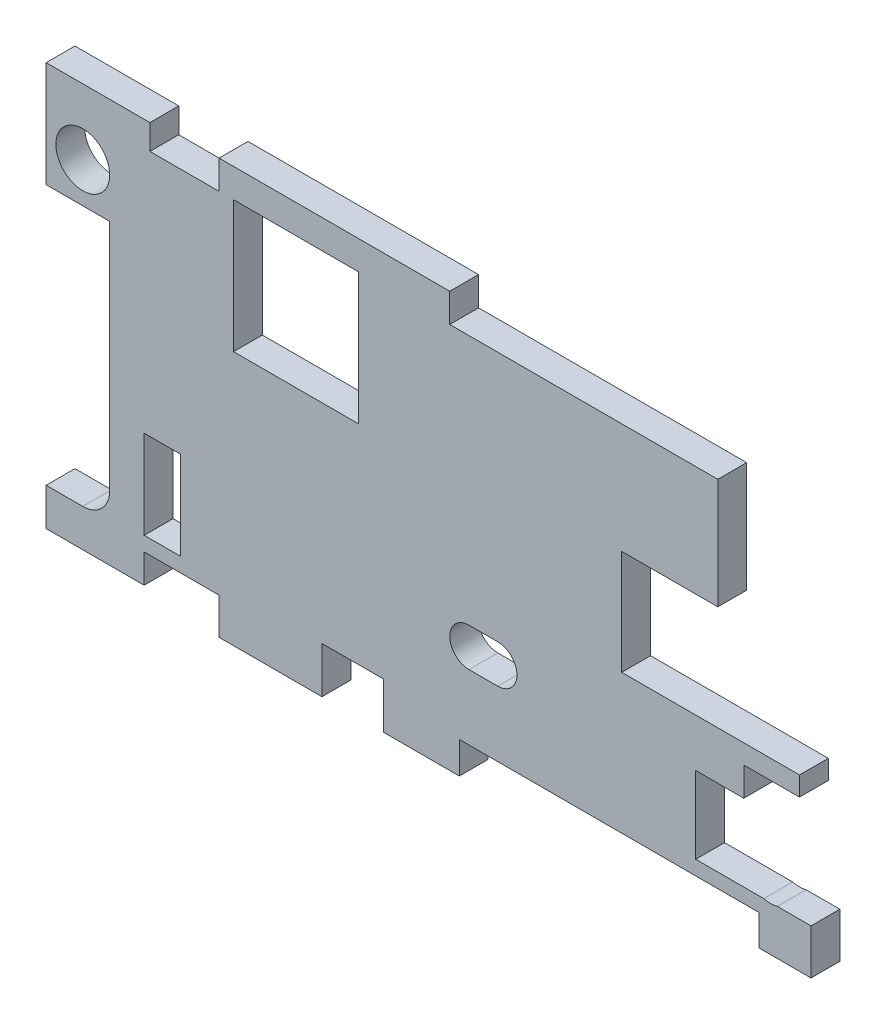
ISO-10303-21;
HEADER;
FILE_DESCRIPTION(('STEP AP214'),'2;1');
FILE_NAME('part.step','',(''),(''),'','','');
FILE_SCHEMA(('AUTOMOTIVE_DESIGN { 1 0 10303 214 1 1 1 1 }'));
ENDSEC;
DATA;
#1=APPLICATION_CONTEXT('core data for automotive mechanical design processes');
#2=APPLICATION_PROTOCOL_DEFINITION('international standard','automotive_design',2000,#1);
#3=PRODUCT_CONTEXT('',#1,'mechanical');
#4=PRODUCT('Part','Part','',(#3));
#5=PRODUCT_RELATED_PRODUCT_CATEGORY('part','',(#4));
#6=PRODUCT_DEFINITION_FORMATION('','',#4);
#7=PRODUCT_DEFINITION_CONTEXT('part definition',#1,'design');
#8=PRODUCT_DEFINITION('design','',#6,#7);
#9=PRODUCT_DEFINITION_SHAPE('','',#8);
#10=(LENGTH_UNIT() NAMED_UNIT(*) SI_UNIT(.MILLI.,.METRE.));
#11=(NAMED_UNIT(*) PLANE_ANGLE_UNIT() SI_UNIT($,.RADIAN.));
#12=(NAMED_UNIT(*) SI_UNIT($,.STERADIAN.) SOLID_ANGLE_UNIT());
#13=UNCERTAINTY_MEASURE_WITH_UNIT(LENGTH_MEASURE(1.E-05),#10,'distance_accuracy_value','');
#14=(GEOMETRIC_REPRESENTATION_CONTEXT(3) GLOBAL_UNCERTAINTY_ASSIGNED_CONTEXT((#13)) GLOBAL_UNIT_ASSIGNED_CONTEXT((#10,
#11,#12)) REPRESENTATION_CONTEXT('',''));
#15=CARTESIAN_POINT('',(0.,0.,0.));
#16=DIRECTION('',(0.,0.,1.));
#17=DIRECTION('',(1.,0.,0.));
#18=AXIS2_PLACEMENT_3D('',#15,#16,#17);
#19=CARTESIAN_POINT('',(10.2,-44.3,3.));
#20=DIRECTION('',(-1.,0.,0.));
#21=DIRECTION('',(0.,0.,1.));
#22=AXIS2_PLACEMENT_3D('',#19,#20,#21);
#23=PLANE('',#22);
#24=DIRECTION('',(0.,1.,0.));
#25=VECTOR('',#24,1.);
#26=CARTESIAN_POINT('',(10.2,-44.3,0.));
#27=LINE('',#26,#25);
#28=CARTESIAN_POINT('',(10.2,-42.,0.));
#29=VERTEX_POINT('',#28);
#30=CARTESIAN_POINT('',(10.2,-39.,0.));
#31=VERTEX_POINT('',#30);
#32=EDGE_CURVE('E534',#29,#31,#27,.T.);
#33=ORIENTED_EDGE('',*,*,#32,.T.);
#34=DIRECTION('',(0.,0.,1.));
#35=VECTOR('',#34,1.);
#36=CARTESIAN_POINT('',(10.2,-39.,0.));
#37=LINE('',#36,#35);
#38=CARTESIAN_POINT('',(10.2,-39.,3.));
#39=VERTEX_POINT('',#38);
#40=EDGE_CURVE('E447',#31,#39,#37,.T.);
#41=ORIENTED_EDGE('',*,*,#40,.T.);
#42=DIRECTION('',(0.,1.,0.));
#43=VECTOR('',#42,1.);
#44=CARTESIAN_POINT('',(10.2,-44.3,3.));
#45=LINE('',#44,#43);
#46=CARTESIAN_POINT('',(10.2,-42.,3.));
#47=VERTEX_POINT('',#46);
#48=EDGE_CURVE('E575',#47,#39,#45,.T.);
#49=ORIENTED_EDGE('',*,*,#48,.F.);
#50=DIRECTION('',(0.,0.,-1.));
#51=VECTOR('',#50,1.);
#52=CARTESIAN_POINT('',(10.2,-42.,3.));
#53=LINE('',#52,#51);
#54=EDGE_CURVE('E464',#47,#29,#53,.T.);
#55=ORIENTED_EDGE('',*,*,#54,.T.);
#56=EDGE_LOOP('',(#33,#41,#49,#55));
#57=FACE_BOUND('',#56,.T.);
#58=ADVANCED_FACE('F40',(#57),#23,.F.);
#59=CARTESIAN_POINT('',(0.,0.,3.));
#60=DIRECTION('',(0.,0.,-1.));
#61=DIRECTION('',(-1.,0.,0.));
#62=AXIS2_PLACEMENT_3D('',#59,#60,#61);
#63=PLANE('',#62);
#64=DIRECTION('',(1.,0.,0.));
#65=VECTOR('',#64,1.);
#66=CARTESIAN_POINT('',(44.0000000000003,-32.7,3.));
#67=LINE('',#66,#65);
#68=CARTESIAN_POINT('',(44.0000000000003,-32.7,3.));
#69=VERTEX_POINT('',#68);
#70=CARTESIAN_POINT('',(47.0000000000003,-32.7,3.));
#71=VERTEX_POINT('',#70);
#72=EDGE_CURVE('E910',#69,#71,#67,.T.);
#73=ORIENTED_EDGE('',*,*,#72,.F.);
#74=CARTESIAN_POINT('',(44.0000000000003,-30.7,3.));
#75=DIRECTION('',(0.,0.,1.));
#76=DIRECTION('',(1.,0.,0.));
#77=AXIS2_PLACEMENT_3D('',#74,#75,#76);
#78=CIRCLE('',#77,2.);
#79=CARTESIAN_POINT('',(44.0000000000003,-28.7,3.));
#80=VERTEX_POINT('',#79);
#81=EDGE_CURVE('E62',#80,#69,#78,.T.);
#82=ORIENTED_EDGE('',*,*,#81,.F.);
#83=DIRECTION('',(-1.,0.,0.));
#84=VECTOR('',#83,1.);
#85=CARTESIAN_POINT('',(44.0000000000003,-28.7,3.));
#86=LINE('',#85,#84);
#87=CARTESIAN_POINT('',(47.0000000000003,-28.7,3.));
#88=VERTEX_POINT('',#87);
#89=EDGE_CURVE('E652',#88,#80,#86,.T.);
#90=ORIENTED_EDGE('',*,*,#89,.F.);
#91=CARTESIAN_POINT('',(47.0000000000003,-30.7,3.));
#92=DIRECTION('',(0.,0.,1.));
#93=DIRECTION('',(1.,0.,0.));
#94=AXIS2_PLACEMENT_3D('',#91,#92,#93);
#95=CIRCLE('',#94,2.);
#96=EDGE_CURVE('E665',#71,#88,#95,.T.);
#97=ORIENTED_EDGE('',*,*,#96,.F.);
#98=EDGE_LOOP('',(#73,#82,#90,#97));
#99=FACE_BOUND('',#98,.T.);
#100=DIRECTION('',(-1.,0.,0.));
#101=VECTOR('',#100,1.);
#102=CARTESIAN_POINT('',(66.4,-39.5,3.));
#103=LINE('',#102,#101);
#104=CARTESIAN_POINT('',(74.2,-39.5,3.));
#105=VERTEX_POINT('',#104);
#106=CARTESIAN_POINT('',(43.,-39.5,3.));
#107=VERTEX_POINT('',#106);
#108=EDGE_CURVE('E374',#105,#107,#103,.T.);
#109=ORIENTED_EDGE('',*,*,#108,.F.);
#110=DIRECTION('',(0.,1.,0.));
#111=VECTOR('',#110,1.);
#112=CARTESIAN_POINT('',(74.2,-42.7,3.));
#113=LINE('',#112,#111);
#114=CARTESIAN_POINT('',(74.2,-42.7,3.));
#115=VERTEX_POINT('',#114);
#116=EDGE_CURVE('E364',#115,#105,#113,.T.);
#117=ORIENTED_EDGE('',*,*,#116,.F.);
#118=DIRECTION('',(1.,0.,0.));
#119=VECTOR('',#118,1.);
#120=CARTESIAN_POINT('',(70.2,-42.7,3.));
#121=LINE('',#120,#119);
#122=CARTESIAN_POINT('',(79.6,-42.7,3.));
#123=VERTEX_POINT('',#122);
#124=EDGE_CURVE('E371',#115,#123,#121,.T.);
#125=ORIENTED_EDGE('',*,*,#124,.T.);
#126=DIRECTION('',(0.,1.,0.));
#127=VECTOR('',#126,1.);
#128=CARTESIAN_POINT('',(79.6,-32.1,3.));
#129=LINE('',#128,#127);
#130=CARTESIAN_POINT('',(79.6,-38.,3.));
#131=VERTEX_POINT('',#130);
#132=EDGE_CURVE('E746',#123,#131,#129,.T.);
#133=ORIENTED_EDGE('',*,*,#132,.T.);
#134=DIRECTION('',(1.,0.,0.));
#135=VECTOR('',#134,1.);
#136=CARTESIAN_POINT('',(73.2,-38.,3.));
#137=LINE('',#136,#135);
#138=CARTESIAN_POINT('',(76.0942016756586,-38.,3.));
#139=VERTEX_POINT('',#138);
#140=EDGE_CURVE('E653',#139,#131,#137,.T.);
#141=ORIENTED_EDGE('',*,*,#140,.F.);
#142=CARTESIAN_POINT('',(75.3900000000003,-35.29,3.));
#143=DIRECTION('',(0.,0.,1.));
#144=DIRECTION('',(1.,0.,0.));
#145=AXIS2_PLACEMENT_3D('',#142,#143,#144);
#146=CIRCLE('',#145,2.79999999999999);
#147=CARTESIAN_POINT('',(74.685798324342,-38.,3.));
#148=VERTEX_POINT('',#147);
#149=EDGE_CURVE('E388',#148,#139,#146,.T.);
#150=ORIENTED_EDGE('',*,*,#149,.F.);
#151=DIRECTION('',(-1.,0.,0.));
#152=VECTOR('',#151,1.);
#153=CARTESIAN_POINT('',(67.6,-38.,3.));
#154=LINE('',#153,#152);
#155=CARTESIAN_POINT('',(67.6,-38.,3.));
#156=VERTEX_POINT('',#155);
#157=EDGE_CURVE('E399',#148,#156,#154,.T.);
#158=ORIENTED_EDGE('',*,*,#157,.T.);
#159=DIRECTION('',(0.,1.,0.));
#160=VECTOR('',#159,1.);
#161=CARTESIAN_POINT('',(67.6,-30.,3.));
#162=LINE('',#161,#160);
#163=CARTESIAN_POINT('',(67.6,-30.,3.));
#164=VERTEX_POINT('',#163);
#165=EDGE_CURVE('E419',#156,#164,#162,.T.);
#166=ORIENTED_EDGE('',*,*,#165,.T.);
#167=DIRECTION('',(1.,0.,0.));
#168=VECTOR('',#167,1.);
#169=CARTESIAN_POINT('',(72.6,-30.,3.));
#170=LINE('',#169,#168);
#171=CARTESIAN_POINT('',(72.6,-30.,3.));
#172=VERTEX_POINT('',#171);
#173=EDGE_CURVE('E422',#164,#172,#170,.T.);
#174=ORIENTED_EDGE('',*,*,#173,.T.);
#175=DIRECTION('',(0.,1.,0.));
#176=VECTOR('',#175,1.);
#177=CARTESIAN_POINT('',(72.6,-27.,3.));
#178=LINE('',#177,#176);
#179=CARTESIAN_POINT('',(72.6,-27.,3.));
#180=VERTEX_POINT('',#179);
#181=EDGE_CURVE('E425',#172,#180,#178,.T.);
#182=ORIENTED_EDGE('',*,*,#181,.T.);
#183=DIRECTION('',(1.,0.,0.));
#184=VECTOR('',#183,1.);
#185=CARTESIAN_POINT('',(72.6,-27.,3.));
#186=LINE('',#185,#184);
#187=CARTESIAN_POINT('',(78.4,-27.,3.));
#188=VERTEX_POINT('',#187);
#189=EDGE_CURVE('E404',#180,#188,#186,.T.);
#190=ORIENTED_EDGE('',*,*,#189,.T.);
#191=DIRECTION('',(0.,-1.,0.));
#192=VECTOR('',#191,1.);
#193=CARTESIAN_POINT('',(78.4,-11.9,3.));
#194=LINE('',#193,#192);
#195=CARTESIAN_POINT('',(78.4,-25.,3.));
#196=VERTEX_POINT('',#195);
#197=EDGE_CURVE('E751',#196,#188,#194,.T.);
#198=ORIENTED_EDGE('',*,*,#197,.F.);
#199=DIRECTION('',(-1.,0.,0.));
#200=VECTOR('',#199,1.);
#201=CARTESIAN_POINT('',(66.4,-25.,3.));
#202=LINE('',#201,#200);
#203=CARTESIAN_POINT('',(59.9,-25.,3.));
#204=VERTEX_POINT('',#203);
#205=EDGE_CURVE('E563',#196,#204,#202,.T.);
#206=ORIENTED_EDGE('',*,*,#205,.T.);
#207=DIRECTION('',(0.,1.,0.));
#208=VECTOR('',#207,1.);
#209=CARTESIAN_POINT('',(59.9,-14.,3.));
#210=LINE('',#209,#208);
#211=CARTESIAN_POINT('',(59.9,-14.1,3.));
#212=VERTEX_POINT('',#211);
#213=EDGE_CURVE('E560',#204,#212,#210,.T.);
#214=ORIENTED_EDGE('',*,*,#213,.T.);
#215=DIRECTION('',(1.,0.,0.));
#216=VECTOR('',#215,1.);
#217=CARTESIAN_POINT('',(59.9,-14.1,3.));
#218=LINE('',#217,#216);
#219=CARTESIAN_POINT('',(69.9,-14.1,3.));
#220=VERTEX_POINT('',#219);
#221=EDGE_CURVE('E698',#212,#220,#218,.T.);
#222=ORIENTED_EDGE('',*,*,#221,.T.);
#223=DIRECTION('',(0.,1.,0.));
#224=VECTOR('',#223,1.);
#225=CARTESIAN_POINT('',(69.9,-2.6,3.));
#226=LINE('',#225,#224);
#227=CARTESIAN_POINT('',(69.9,-2.6,3.));
#228=VERTEX_POINT('',#227);
#229=EDGE_CURVE('E382',#220,#228,#226,.T.);
#230=ORIENTED_EDGE('',*,*,#229,.T.);
#231=DIRECTION('',(-1.,0.,0.));
#232=VECTOR('',#231,1.);
#233=CARTESIAN_POINT('',(32.5,-2.6,3.));
#234=LINE('',#233,#232);
#235=CARTESIAN_POINT('',(42.,-2.6,3.));
#236=VERTEX_POINT('',#235);
#237=EDGE_CURVE('E557',#228,#236,#234,.T.);
#238=ORIENTED_EDGE('',*,*,#237,.T.);
#239=DIRECTION('',(0.,1.,0.));
#240=VECTOR('',#239,1.);
#241=CARTESIAN_POINT('',(42.,0.399999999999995,3.));
#242=LINE('',#241,#240);
#243=CARTESIAN_POINT('',(42.,0.399999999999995,3.));
#244=VERTEX_POINT('',#243);
#245=EDGE_CURVE('E720',#236,#244,#242,.T.);
#246=ORIENTED_EDGE('',*,*,#245,.T.);
#247=DIRECTION('',(-1.,0.,0.));
#248=VECTOR('',#247,1.);
#249=CARTESIAN_POINT('',(18.,0.399999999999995,3.));
#250=LINE('',#249,#248);
#251=CARTESIAN_POINT('',(18.,0.399999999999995,3.));
#252=VERTEX_POINT('',#251);
#253=EDGE_CURVE('E716',#244,#252,#250,.T.);
#254=ORIENTED_EDGE('',*,*,#253,.T.);
#255=DIRECTION('',(0.,-1.,0.));
#256=VECTOR('',#255,1.);
#257=CARTESIAN_POINT('',(18.,0.399999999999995,3.));
#258=LINE('',#257,#256);
#259=CARTESIAN_POINT('',(18.,-2.6,3.));
#260=VERTEX_POINT('',#259);
#261=EDGE_CURVE('E715',#252,#260,#258,.T.);
#262=ORIENTED_EDGE('',*,*,#261,.T.);
#263=DIRECTION('',(-1.,0.,0.));
#264=VECTOR('',#263,1.);
#265=CARTESIAN_POINT('',(10.8,-2.6,3.));
#266=LINE('',#265,#264);
#267=CARTESIAN_POINT('',(10.8,-2.6,3.));
#268=VERTEX_POINT('',#267);
#269=EDGE_CURVE('E548',#260,#268,#266,.T.);
#270=ORIENTED_EDGE('',*,*,#269,.T.);
#271=DIRECTION('',(0.,1.,0.));
#272=VECTOR('',#271,1.);
#273=CARTESIAN_POINT('',(10.8,0.,3.));
#274=LINE('',#273,#272);
#275=CARTESIAN_POINT('',(10.8,0.,3.));
#276=VERTEX_POINT('',#275);
#277=EDGE_CURVE('E546',#268,#276,#274,.T.);
#278=ORIENTED_EDGE('',*,*,#277,.T.);
#279=DIRECTION('',(-1.,0.,0.));
#280=VECTOR('',#279,1.);
#281=CARTESIAN_POINT('',(0.,0.,3.));
#282=LINE('',#281,#280);
#283=CARTESIAN_POINT('',(0.,0.,3.));
#284=VERTEX_POINT('',#283);
#285=EDGE_CURVE('E544',#276,#284,#282,.T.);
#286=ORIENTED_EDGE('',*,*,#285,.T.);
#287=DIRECTION('',(0.,-1.,0.));
#288=VECTOR('',#287,1.);
#289=CARTESIAN_POINT('',(0.,-12.3,3.));
#290=LINE('',#289,#288);
#291=CARTESIAN_POINT('',(0.,-11.,3.));
#292=VERTEX_POINT('',#291);
#293=EDGE_CURVE('E540',#284,#292,#290,.T.);
#294=ORIENTED_EDGE('',*,*,#293,.T.);
#295=DIRECTION('',(-1.,0.,0.));
#296=VECTOR('',#295,1.);
#297=CARTESIAN_POINT('',(0.,-11.,3.));
#298=LINE('',#297,#296);
#299=CARTESIAN_POINT('',(6.6100000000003,-11.,3.));
#300=VERTEX_POINT('',#299);
#301=EDGE_CURVE('E614',#300,#292,#298,.T.);
#302=ORIENTED_EDGE('',*,*,#301,.F.);
#303=DIRECTION('',(0.,1.,0.));
#304=VECTOR('',#303,1.);
#305=CARTESIAN_POINT('',(6.6100000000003,-11.,3.));
#306=LINE('',#305,#304);
#307=CARTESIAN_POINT('',(6.6100000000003,-35.29,3.));
#308=VERTEX_POINT('',#307);
#309=EDGE_CURVE('E683',#308,#300,#306,.T.);
#310=ORIENTED_EDGE('',*,*,#309,.F.);
#311=CARTESIAN_POINT('',(3.8100000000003,-35.29,3.));
#312=DIRECTION('',(0.,0.,1.));
#313=DIRECTION('',(1.,0.,0.));
#314=AXIS2_PLACEMENT_3D('',#311,#312,#313);
#315=CIRCLE('',#314,2.8);
#316=CARTESIAN_POINT('',(3.8100000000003,-38.09,3.));
#317=VERTEX_POINT('',#316);
#318=EDGE_CURVE('E593',#317,#308,#315,.T.);
#319=ORIENTED_EDGE('',*,*,#318,.F.);
#320=DIRECTION('',(1.,0.,0.));
#321=VECTOR('',#320,1.);
#322=CARTESIAN_POINT('',(3.8100000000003,-38.09,3.));
#323=LINE('',#322,#321);
#324=CARTESIAN_POINT('',(0.,-38.09,3.));
#325=VERTEX_POINT('',#324);
#326=EDGE_CURVE('E688',#325,#317,#323,.T.);
#327=ORIENTED_EDGE('',*,*,#326,.F.);
#328=DIRECTION('',(0.,-1.,0.));
#329=VECTOR('',#328,1.);
#330=CARTESIAN_POINT('',(0.,-32.3,3.));
#331=LINE('',#330,#329);
#332=CARTESIAN_POINT('',(0.,-42.,3.));
#333=VERTEX_POINT('',#332);
#334=EDGE_CURVE('E450',#325,#333,#331,.T.);
#335=ORIENTED_EDGE('',*,*,#334,.T.);
#336=DIRECTION('',(-1.,0.,0.));
#337=VECTOR('',#336,1.);
#338=CARTESIAN_POINT('',(0.,-42.,3.));
#339=LINE('',#338,#337);
#340=EDGE_CURVE('E608',#47,#333,#339,.T.);
#341=ORIENTED_EDGE('',*,*,#340,.F.);
#342=ORIENTED_EDGE('',*,*,#48,.T.);
#343=DIRECTION('',(-1.,0.,0.));
#344=VECTOR('',#343,1.);
#345=CARTESIAN_POINT('',(14.,-39.,3.));
#346=LINE('',#345,#344);
#347=CARTESIAN_POINT('',(18.,-39.,3.));
#348=VERTEX_POINT('',#347);
#349=EDGE_CURVE('E604',#348,#39,#346,.T.);
#350=ORIENTED_EDGE('',*,*,#349,.F.);
#351=DIRECTION('',(0.,-1.,0.));
#352=VECTOR('',#351,1.);
#353=CARTESIAN_POINT('',(18.,-48.8,3.));
#354=LINE('',#353,#352);
#355=CARTESIAN_POINT('',(18.,-42.8,3.));
#356=VERTEX_POINT('',#355);
#357=EDGE_CURVE('E567',#348,#356,#354,.T.);
#358=ORIENTED_EDGE('',*,*,#357,.T.);
#359=DIRECTION('',(-1.,0.,0.));
#360=VECTOR('',#359,1.);
#361=CARTESIAN_POINT('',(18.,-42.8,3.));
#362=LINE('',#361,#360);
#363=CARTESIAN_POINT('',(28.7,-42.8,3.));
#364=VERTEX_POINT('',#363);
#365=EDGE_CURVE('E756',#364,#356,#362,.T.);
#366=ORIENTED_EDGE('',*,*,#365,.F.);
#367=DIRECTION('',(0.,-1.,0.));
#368=VECTOR('',#367,1.);
#369=CARTESIAN_POINT('',(28.7,-38.8,3.));
#370=LINE('',#369,#368);
#371=CARTESIAN_POINT('',(28.7,-38.,3.));
#372=VERTEX_POINT('',#371);
#373=EDGE_CURVE('E513',#372,#364,#370,.T.);
#374=ORIENTED_EDGE('',*,*,#373,.F.);
#375=DIRECTION('',(-1.,0.,0.));
#376=VECTOR('',#375,1.);
#377=CARTESIAN_POINT('',(28.7,-38.,3.));
#378=LINE('',#377,#376);
#379=CARTESIAN_POINT('',(35.1,-38.,3.));
#380=VERTEX_POINT('',#379);
#381=EDGE_CURVE('E463',#380,#372,#378,.T.);
#382=ORIENTED_EDGE('',*,*,#381,.F.);
#383=DIRECTION('',(0.,1.,0.));
#384=VECTOR('',#383,1.);
#385=CARTESIAN_POINT('',(35.1,-42.8,3.));
#386=LINE('',#385,#384);
#387=CARTESIAN_POINT('',(35.1,-42.8,3.));
#388=VERTEX_POINT('',#387);
#389=EDGE_CURVE('E615',#388,#380,#386,.T.);
#390=ORIENTED_EDGE('',*,*,#389,.F.);
#391=CARTESIAN_POINT('',(43.,-42.8,3.));
#392=VERTEX_POINT('',#391);
#393=EDGE_CURVE('E757',#392,#388,#362,.T.);
#394=ORIENTED_EDGE('',*,*,#393,.F.);
#395=DIRECTION('',(0.,1.,0.));
#396=VECTOR('',#395,1.);
#397=CARTESIAN_POINT('',(43.,-40.8,3.));
#398=LINE('',#397,#396);
#399=EDGE_CURVE('E565',#392,#107,#398,.T.);
#400=ORIENTED_EDGE('',*,*,#399,.T.);
#401=EDGE_LOOP('',(#109,#117,#125,#133,#141,#150,#158,#166,#174,#182,#190,#198,#206,#214,#222,
#230,#238,#246,#254,#262,#270,#278,#286,#294,#302,#310,#319,#327,#335,#341,#342,#350,#358,#366,
#374,#382,#390,#394,#400));
#402=FACE_BOUND('',#401,.T.);
#403=DIRECTION('',(1.,0.,0.));
#404=VECTOR('',#403,1.);
#405=CARTESIAN_POINT('',(18.,-2.6,3.));
#406=LINE('',#405,#404);
#407=CARTESIAN_POINT('',(19.5,-2.6,3.));
#408=VERTEX_POINT('',#407);
#409=CARTESIAN_POINT('',(32.5,-2.6,3.));
#410=VERTEX_POINT('',#409);
#411=EDGE_CURVE('E723',#408,#410,#406,.T.);
#412=ORIENTED_EDGE('',*,*,#411,.T.);
#413=DIRECTION('',(0.,-1.,0.));
#414=VECTOR('',#413,1.);
#415=CARTESIAN_POINT('',(32.5,-16.3,3.));
#416=LINE('',#415,#414);
#417=CARTESIAN_POINT('',(32.5,-16.3,3.));
#418=VERTEX_POINT('',#417);
#419=EDGE_CURVE('E555',#410,#418,#416,.T.);
#420=ORIENTED_EDGE('',*,*,#419,.T.);
#421=DIRECTION('',(-1.,0.,0.));
#422=VECTOR('',#421,1.);
#423=CARTESIAN_POINT('',(19.5,-16.3,3.));
#424=LINE('',#423,#422);
#425=CARTESIAN_POINT('',(19.5,-16.3,3.));
#426=VERTEX_POINT('',#425);
#427=EDGE_CURVE('E553',#418,#426,#424,.T.);
#428=ORIENTED_EDGE('',*,*,#427,.T.);
#429=DIRECTION('',(0.,1.,0.));
#430=VECTOR('',#429,1.);
#431=CARTESIAN_POINT('',(19.5,-2.6,3.));
#432=LINE('',#431,#430);
#433=EDGE_CURVE('E550',#426,#408,#432,.T.);
#434=ORIENTED_EDGE('',*,*,#433,.T.);
#435=EDGE_LOOP('',(#412,#420,#428,#434));
#436=FACE_BOUND('',#435,.T.);
#437=CARTESIAN_POINT('',(3.81,-6.84,3.));
#438=DIRECTION('',(0.,0.,1.));
#439=DIRECTION('',(1.,0.,0.));
#440=AXIS2_PLACEMENT_3D('',#437,#438,#439);
#441=CIRCLE('',#440,2.8);
#442=CARTESIAN_POINT('',(6.61,-6.84,3.));
#443=VERTEX_POINT('',#442);
#444=EDGE_CURVE('E583',#443,#443,#441,.T.);
#445=ORIENTED_EDGE('',*,*,#444,.F.);
#446=EDGE_LOOP('',(#445));
#447=FACE_BOUND('',#446,.T.);
#448=DIRECTION('',(-1.,0.,0.));
#449=VECTOR('',#448,1.);
#450=CARTESIAN_POINT('',(14.,-37.5,3.));
#451=LINE('',#450,#449);
#452=CARTESIAN_POINT('',(14.,-37.5,3.));
#453=VERTEX_POINT('',#452);
#454=CARTESIAN_POINT('',(10.2,-37.5,3.));
#455=VERTEX_POINT('',#454);
#456=EDGE_CURVE('E432',#453,#455,#451,.T.);
#457=ORIENTED_EDGE('',*,*,#456,.T.);
#458=CARTESIAN_POINT('',(10.2,-28.3,3.));
#459=VERTEX_POINT('',#458);
#460=EDGE_CURVE('E578',#455,#459,#45,.T.);
#461=ORIENTED_EDGE('',*,*,#460,.T.);
#462=DIRECTION('',(1.,0.,0.));
#463=VECTOR('',#462,1.);
#464=CARTESIAN_POINT('',(14.,-28.3,3.));
#465=LINE('',#464,#463);
#466=CARTESIAN_POINT('',(14.,-28.3,3.));
#467=VERTEX_POINT('',#466);
#468=EDGE_CURVE('E573',#459,#467,#465,.T.);
#469=ORIENTED_EDGE('',*,*,#468,.T.);
#470=DIRECTION('',(0.,-1.,0.));
#471=VECTOR('',#470,1.);
#472=CARTESIAN_POINT('',(14.,-39.3,3.));
#473=LINE('',#472,#471);
#474=EDGE_CURVE('E570',#467,#453,#473,.T.);
#475=ORIENTED_EDGE('',*,*,#474,.T.);
#476=EDGE_LOOP('',(#457,#461,#469,#475));
#477=FACE_BOUND('',#476,.T.);
#478=ADVANCED_FACE('F42',(#99,#402,#436,#447,#477),#63,.F.);
#479=CARTESIAN_POINT('',(0.,0.,0.));
#480=DIRECTION('',(0.,0.,-1.));
#481=DIRECTION('',(-1.,0.,0.));
#482=AXIS2_PLACEMENT_3D('',#479,#480,#481);
#483=PLANE('',#482);
#484=DIRECTION('',(0.,-1.,0.));
#485=VECTOR('',#484,1.);
#486=CARTESIAN_POINT('',(74.2,0.,0.));
#487=LINE('',#486,#485);
#488=CARTESIAN_POINT('',(74.2,-39.5,0.));
#489=VERTEX_POINT('',#488);
#490=CARTESIAN_POINT('',(74.2,-42.7,0.));
#491=VERTEX_POINT('',#490);
#492=EDGE_CURVE('E55',#489,#491,#487,.T.);
#493=ORIENTED_EDGE('',*,*,#492,.F.);
#494=DIRECTION('',(1.,0.,0.));
#495=VECTOR('',#494,1.);
#496=CARTESIAN_POINT('',(0.,-39.5,0.));
#497=LINE('',#496,#495);
#498=CARTESIAN_POINT('',(43.,-39.5,0.));
#499=VERTEX_POINT('',#498);
#500=EDGE_CURVE('E609',#499,#489,#497,.T.);
#501=ORIENTED_EDGE('',*,*,#500,.F.);
#502=DIRECTION('',(0.,1.,0.));
#503=VECTOR('',#502,1.);
#504=CARTESIAN_POINT('',(43.,-40.8,0.));
#505=LINE('',#504,#503);
#506=CARTESIAN_POINT('',(43.,-42.8,0.));
#507=VERTEX_POINT('',#506);
#508=EDGE_CURVE('E528',#507,#499,#505,.T.);
#509=ORIENTED_EDGE('',*,*,#508,.F.);
#510=DIRECTION('',(1.,0.,0.));
#511=VECTOR('',#510,1.);
#512=CARTESIAN_POINT('',(0.,-42.8,0.));
#513=LINE('',#512,#511);
#514=CARTESIAN_POINT('',(35.1,-42.8,0.));
#515=VERTEX_POINT('',#514);
#516=EDGE_CURVE('E763',#515,#507,#513,.T.);
#517=ORIENTED_EDGE('',*,*,#516,.F.);
#518=DIRECTION('',(0.,-1.,0.));
#519=VECTOR('',#518,1.);
#520=CARTESIAN_POINT('',(35.1,0.,0.));
#521=LINE('',#520,#519);
#522=CARTESIAN_POINT('',(35.1,-38.,0.));
#523=VERTEX_POINT('',#522);
#524=EDGE_CURVE('E459',#523,#515,#521,.T.);
#525=ORIENTED_EDGE('',*,*,#524,.F.);
#526=DIRECTION('',(1.,0.,0.));
#527=VECTOR('',#526,1.);
#528=CARTESIAN_POINT('',(0.,-38.,0.));
#529=LINE('',#528,#527);
#530=CARTESIAN_POINT('',(28.7,-38.,0.));
#531=VERTEX_POINT('',#530);
#532=EDGE_CURVE('E455',#531,#523,#529,.T.);
#533=ORIENTED_EDGE('',*,*,#532,.F.);
#534=DIRECTION('',(0.,-1.,0.));
#535=VECTOR('',#534,1.);
#536=CARTESIAN_POINT('',(28.7,-38.8,0.));
#537=LINE('',#536,#535);
#538=CARTESIAN_POINT('',(28.7,-42.8,0.));
#539=VERTEX_POINT('',#538);
#540=EDGE_CURVE('E543',#531,#539,#537,.T.);
#541=ORIENTED_EDGE('',*,*,#540,.T.);
#542=CARTESIAN_POINT('',(18.,-42.8,0.));
#543=VERTEX_POINT('',#542);
#544=EDGE_CURVE('E765',#543,#539,#513,.T.);
#545=ORIENTED_EDGE('',*,*,#544,.F.);
#546=DIRECTION('',(0.,-1.,0.));
#547=VECTOR('',#546,1.);
#548=CARTESIAN_POINT('',(18.,-48.8,0.));
#549=LINE('',#548,#547);
#550=CARTESIAN_POINT('',(18.,-39.,0.));
#551=VERTEX_POINT('',#550);
#552=EDGE_CURVE('E482',#551,#543,#549,.T.);
#553=ORIENTED_EDGE('',*,*,#552,.F.);
#554=DIRECTION('',(1.,0.,0.));
#555=VECTOR('',#554,1.);
#556=CARTESIAN_POINT('',(0.,-39.,0.));
#557=LINE('',#556,#555);
#558=EDGE_CURVE('E598',#31,#551,#557,.T.);
#559=ORIENTED_EDGE('',*,*,#558,.F.);
#560=ORIENTED_EDGE('',*,*,#32,.F.);
#561=DIRECTION('',(1.,0.,0.));
#562=VECTOR('',#561,1.);
#563=CARTESIAN_POINT('',(0.,-42.,0.));
#564=LINE('',#563,#562);
#565=CARTESIAN_POINT('',(0.,-42.,0.));
#566=VERTEX_POINT('',#565);
#567=EDGE_CURVE('E606',#566,#29,#564,.T.);
#568=ORIENTED_EDGE('',*,*,#567,.F.);
#569=DIRECTION('',(0.,-1.,0.));
#570=VECTOR('',#569,1.);
#571=CARTESIAN_POINT('',(0.,-32.3,0.));
#572=LINE('',#571,#570);
#573=CARTESIAN_POINT('',(0.,-38.09,0.));
#574=VERTEX_POINT('',#573);
#575=EDGE_CURVE('E537',#574,#566,#572,.T.);
#576=ORIENTED_EDGE('',*,*,#575,.F.);
#577=DIRECTION('',(1.,0.,0.));
#578=VECTOR('',#577,1.);
#579=CARTESIAN_POINT('',(3.8100000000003,-38.09,0.));
#580=LINE('',#579,#578);
#581=CARTESIAN_POINT('',(3.8100000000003,-38.09,0.));
#582=VERTEX_POINT('',#581);
#583=EDGE_CURVE('E687',#574,#582,#580,.T.);
#584=ORIENTED_EDGE('',*,*,#583,.T.);
#585=CARTESIAN_POINT('',(3.8100000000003,-35.29,0.));
#586=DIRECTION('',(0.,0.,1.));
#587=DIRECTION('',(1.,0.,0.));
#588=AXIS2_PLACEMENT_3D('',#585,#586,#587);
#589=CIRCLE('',#588,2.8);
#590=CARTESIAN_POINT('',(6.6100000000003,-35.29,0.));
#591=VERTEX_POINT('',#590);
#592=EDGE_CURVE('E539',#582,#591,#589,.T.);
#593=ORIENTED_EDGE('',*,*,#592,.T.);
#594=DIRECTION('',(0.,1.,0.));
#595=VECTOR('',#594,1.);
#596=CARTESIAN_POINT('',(6.6100000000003,-35.29,0.));
#597=LINE('',#596,#595);
#598=CARTESIAN_POINT('',(6.6100000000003,-11.,0.));
#599=VERTEX_POINT('',#598);
#600=EDGE_CURVE('E684',#591,#599,#597,.T.);
#601=ORIENTED_EDGE('',*,*,#600,.T.);
#602=DIRECTION('',(1.,0.,0.));
#603=VECTOR('',#602,1.);
#604=CARTESIAN_POINT('',(0.,-11.,0.));
#605=LINE('',#604,#603);
#606=CARTESIAN_POINT('',(0.,-11.,0.));
#607=VERTEX_POINT('',#606);
#608=EDGE_CURVE('E612',#607,#599,#605,.T.);
#609=ORIENTED_EDGE('',*,*,#608,.F.);
#610=DIRECTION('',(0.,-1.,0.));
#611=VECTOR('',#610,1.);
#612=CARTESIAN_POINT('',(0.,-12.3,0.));
#613=LINE('',#612,#611);
#614=CARTESIAN_POINT('',(0.,0.,0.));
#615=VERTEX_POINT('',#614);
#616=EDGE_CURVE('E473',#615,#607,#613,.T.);
#617=ORIENTED_EDGE('',*,*,#616,.F.);
#618=DIRECTION('',(-1.,0.,0.));
#619=VECTOR('',#618,1.);
#620=CARTESIAN_POINT('',(0.,0.,0.));
#621=LINE('',#620,#619);
#622=CARTESIAN_POINT('',(10.8,0.,0.));
#623=VERTEX_POINT('',#622);
#624=EDGE_CURVE('E507',#623,#615,#621,.T.);
#625=ORIENTED_EDGE('',*,*,#624,.F.);
#626=DIRECTION('',(0.,1.,0.));
#627=VECTOR('',#626,1.);
#628=CARTESIAN_POINT('',(10.8,0.,0.));
#629=LINE('',#628,#627);
#630=CARTESIAN_POINT('',(10.8,-2.6,0.));
#631=VERTEX_POINT('',#630);
#632=EDGE_CURVE('E503',#631,#623,#629,.T.);
#633=ORIENTED_EDGE('',*,*,#632,.F.);
#634=DIRECTION('',(-1.,0.,0.));
#635=VECTOR('',#634,1.);
#636=CARTESIAN_POINT('',(10.8,-2.6,0.));
#637=LINE('',#636,#635);
#638=CARTESIAN_POINT('',(18.,-2.6,0.));
#639=VERTEX_POINT('',#638);
#640=EDGE_CURVE('E500',#639,#631,#637,.T.);
#641=ORIENTED_EDGE('',*,*,#640,.F.);
#642=DIRECTION('',(0.,-1.,0.));
#643=VECTOR('',#642,1.);
#644=CARTESIAN_POINT('',(18.,0.399999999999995,0.));
#645=LINE('',#644,#643);
#646=CARTESIAN_POINT('',(18.,0.399999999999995,0.));
#647=VERTEX_POINT('',#646);
#648=EDGE_CURVE('E730',#647,#639,#645,.T.);
#649=ORIENTED_EDGE('',*,*,#648,.F.);
#650=DIRECTION('',(-1.,0.,0.));
#651=VECTOR('',#650,1.);
#652=CARTESIAN_POINT('',(18.,0.399999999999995,0.));
#653=LINE('',#652,#651);
#654=CARTESIAN_POINT('',(42.,0.399999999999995,0.));
#655=VERTEX_POINT('',#654);
#656=EDGE_CURVE('E734',#655,#647,#653,.T.);
#657=ORIENTED_EDGE('',*,*,#656,.F.);
#658=DIRECTION('',(0.,1.,0.));
#659=VECTOR('',#658,1.);
#660=CARTESIAN_POINT('',(42.,0.399999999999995,0.));
#661=LINE('',#660,#659);
#662=CARTESIAN_POINT('',(42.,-2.6,0.));
#663=VERTEX_POINT('',#662);
#664=EDGE_CURVE('E738',#663,#655,#661,.T.);
#665=ORIENTED_EDGE('',*,*,#664,.F.);
#666=DIRECTION('',(-1.,0.,0.));
#667=VECTOR('',#666,1.);
#668=CARTESIAN_POINT('',(32.5,-2.6,0.));
#669=LINE('',#668,#667);
#670=CARTESIAN_POINT('',(69.9,-2.6,0.));
#671=VERTEX_POINT('',#670);
#672=EDGE_CURVE('E486',#671,#663,#669,.T.);
#673=ORIENTED_EDGE('',*,*,#672,.F.);
#674=DIRECTION('',(0.,1.,0.));
#675=VECTOR('',#674,1.);
#676=CARTESIAN_POINT('',(69.9,-2.6,0.));
#677=LINE('',#676,#675);
#678=CARTESIAN_POINT('',(69.9,-14.1,0.));
#679=VERTEX_POINT('',#678);
#680=EDGE_CURVE('E386',#679,#671,#677,.T.);
#681=ORIENTED_EDGE('',*,*,#680,.F.);
#682=DIRECTION('',(1.,0.,0.));
#683=VECTOR('',#682,1.);
#684=CARTESIAN_POINT('',(59.9,-14.1,0.));
#685=LINE('',#684,#683);
#686=CARTESIAN_POINT('',(59.9,-14.1,0.));
#687=VERTEX_POINT('',#686);
#688=EDGE_CURVE('E707',#687,#679,#685,.T.);
#689=ORIENTED_EDGE('',*,*,#688,.F.);
#690=DIRECTION('',(0.,1.,0.));
#691=VECTOR('',#690,1.);
#692=CARTESIAN_POINT('',(59.9,-14.,0.));
#693=LINE('',#692,#691);
#694=CARTESIAN_POINT('',(59.9,-25.,0.));
#695=VERTEX_POINT('',#694);
#696=EDGE_CURVE('E487',#695,#687,#693,.T.);
#697=ORIENTED_EDGE('',*,*,#696,.F.);
#698=DIRECTION('',(-1.,0.,0.));
#699=VECTOR('',#698,1.);
#700=CARTESIAN_POINT('',(59.9,-25.,0.));
#701=LINE('',#700,#699);
#702=CARTESIAN_POINT('',(78.4,-25.,0.));
#703=VERTEX_POINT('',#702);
#704=EDGE_CURVE('E526',#703,#695,#701,.T.);
#705=ORIENTED_EDGE('',*,*,#704,.F.);
#706=DIRECTION('',(0.,1.,0.));
#707=VECTOR('',#706,1.);
#708=CARTESIAN_POINT('',(78.4,0.,0.));
#709=LINE('',#708,#707);
#710=CARTESIAN_POINT('',(78.4,-27.,0.));
#711=VERTEX_POINT('',#710);
#712=EDGE_CURVE('E754',#711,#703,#709,.T.);
#713=ORIENTED_EDGE('',*,*,#712,.F.);
#714=DIRECTION('',(1.,0.,0.));
#715=VECTOR('',#714,1.);
#716=CARTESIAN_POINT('',(72.6,-27.,0.));
#717=LINE('',#716,#715);
#718=CARTESIAN_POINT('',(72.6,-27.,0.));
#719=VERTEX_POINT('',#718);
#720=EDGE_CURVE('E413',#719,#711,#717,.T.);
#721=ORIENTED_EDGE('',*,*,#720,.F.);
#722=DIRECTION('',(0.,1.,0.));
#723=VECTOR('',#722,1.);
#724=CARTESIAN_POINT('',(72.6,-27.,0.));
#725=LINE('',#724,#723);
#726=CARTESIAN_POINT('',(72.6,-30.,0.));
#727=VERTEX_POINT('',#726);
#728=EDGE_CURVE('E410',#727,#719,#725,.T.);
#729=ORIENTED_EDGE('',*,*,#728,.F.);
#730=DIRECTION('',(1.,0.,0.));
#731=VECTOR('',#730,1.);
#732=CARTESIAN_POINT('',(72.6,-30.,0.));
#733=LINE('',#732,#731);
#734=CARTESIAN_POINT('',(67.6,-30.,0.));
#735=VERTEX_POINT('',#734);
#736=EDGE_CURVE('E407',#735,#727,#733,.T.);
#737=ORIENTED_EDGE('',*,*,#736,.F.);
#738=DIRECTION('',(0.,1.,0.));
#739=VECTOR('',#738,1.);
#740=CARTESIAN_POINT('',(67.6,-30.,0.));
#741=LINE('',#740,#739);
#742=CARTESIAN_POINT('',(67.6,-38.,0.));
#743=VERTEX_POINT('',#742);
#744=EDGE_CURVE('E403',#743,#735,#741,.T.);
#745=ORIENTED_EDGE('',*,*,#744,.F.);
#746=DIRECTION('',(-1.,0.,0.));
#747=VECTOR('',#746,1.);
#748=CARTESIAN_POINT('',(67.6,-38.,0.));
#749=LINE('',#748,#747);
#750=CARTESIAN_POINT('',(74.685798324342,-38.,0.));
#751=VERTEX_POINT('',#750);
#752=EDGE_CURVE('E400',#751,#743,#749,.T.);
#753=ORIENTED_EDGE('',*,*,#752,.F.);
#754=CARTESIAN_POINT('',(75.3900000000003,-35.29,0.));
#755=DIRECTION('',(0.,0.,1.));
#756=DIRECTION('',(1.,0.,0.));
#757=AXIS2_PLACEMENT_3D('',#754,#755,#756);
#758=CIRCLE('',#757,2.79999999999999);
#759=CARTESIAN_POINT('',(76.0942016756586,-38.,0.));
#760=VERTEX_POINT('',#759);
#761=EDGE_CURVE('E391',#751,#760,#758,.T.);
#762=ORIENTED_EDGE('',*,*,#761,.T.);
#763=DIRECTION('',(1.,0.,0.));
#764=VECTOR('',#763,1.);
#765=CARTESIAN_POINT('',(73.2,-38.,0.));
#766=LINE('',#765,#764);
#767=CARTESIAN_POINT('',(79.6,-38.,0.));
#768=VERTEX_POINT('',#767);
#769=EDGE_CURVE('E671',#760,#768,#766,.T.);
#770=ORIENTED_EDGE('',*,*,#769,.T.);
#771=DIRECTION('',(0.,1.,0.));
#772=VECTOR('',#771,1.);
#773=CARTESIAN_POINT('',(79.6,-32.1,0.));
#774=LINE('',#773,#772);
#775=CARTESIAN_POINT('',(79.6,-42.7,0.));
#776=VERTEX_POINT('',#775);
#777=EDGE_CURVE('E748',#776,#768,#774,.T.);
#778=ORIENTED_EDGE('',*,*,#777,.F.);
#779=DIRECTION('',(1.,0.,0.));
#780=VECTOR('',#779,1.);
#781=CARTESIAN_POINT('',(70.2,-42.7,0.));
#782=LINE('',#781,#780);
#783=EDGE_CURVE('E383',#491,#776,#782,.T.);
#784=ORIENTED_EDGE('',*,*,#783,.F.);
#785=EDGE_LOOP('',(#493,#501,#509,#517,#525,#533,#541,#545,#553,#559,#560,#568,#576,#584,#593,
#601,#609,#617,#625,#633,#641,#649,#657,#665,#673,#681,#689,#697,#705,#713,#721,#729,#737,#745,
#753,#762,#770,#778,#784));
#786=FACE_BOUND('',#785,.T.);
#787=CARTESIAN_POINT('',(44.0000000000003,-30.7,0.));
#788=DIRECTION('',(0.,0.,-1.));
#789=DIRECTION('',(-1.,0.,0.));
#790=AXIS2_PLACEMENT_3D('',#787,#788,#789);
#791=CIRCLE('',#790,2.);
#792=CARTESIAN_POINT('',(44.0000000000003,-32.7,0.));
#793=VERTEX_POINT('',#792);
#794=CARTESIAN_POINT('',(44.0000000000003,-28.7,0.));
#795=VERTEX_POINT('',#794);
#796=EDGE_CURVE('E48',#793,#795,#791,.T.);
#797=ORIENTED_EDGE('',*,*,#796,.F.);
#798=DIRECTION('',(-1.,0.,0.));
#799=VECTOR('',#798,1.);
#800=CARTESIAN_POINT('',(0.,-32.7,0.));
#801=LINE('',#800,#799);
#802=CARTESIAN_POINT('',(47.0000000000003,-32.7,0.));
#803=VERTEX_POINT('',#802);
#804=EDGE_CURVE('E633',#803,#793,#801,.T.);
#805=ORIENTED_EDGE('',*,*,#804,.F.);
#806=CARTESIAN_POINT('',(47.0000000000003,-30.7,0.));
#807=DIRECTION('',(0.,0.,-1.));
#808=DIRECTION('',(-1.,0.,0.));
#809=AXIS2_PLACEMENT_3D('',#806,#807,#808);
#810=CIRCLE('',#809,2.);
#811=CARTESIAN_POINT('',(47.0000000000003,-28.7,0.));
#812=VERTEX_POINT('',#811);
#813=EDGE_CURVE('E635',#812,#803,#810,.T.);
#814=ORIENTED_EDGE('',*,*,#813,.F.);
#815=DIRECTION('',(1.,0.,0.));
#816=VECTOR('',#815,1.);
#817=CARTESIAN_POINT('',(0.,-28.7,0.));
#818=LINE('',#817,#816);
#819=EDGE_CURVE('E638',#795,#812,#818,.T.);
#820=ORIENTED_EDGE('',*,*,#819,.F.);
#821=EDGE_LOOP('',(#797,#805,#814,#820));
#822=FACE_BOUND('',#821,.T.);
#823=DIRECTION('',(0.,-1.,0.));
#824=VECTOR('',#823,1.);
#825=CARTESIAN_POINT('',(32.5,-16.3,0.));
#826=LINE('',#825,#824);
#827=CARTESIAN_POINT('',(32.5,-2.6,0.));
#828=VERTEX_POINT('',#827);
#829=CARTESIAN_POINT('',(32.5,-16.3,0.));
#830=VERTEX_POINT('',#829);
#831=EDGE_CURVE('E492',#828,#830,#826,.T.);
#832=ORIENTED_EDGE('',*,*,#831,.F.);
#833=DIRECTION('',(1.,0.,0.));
#834=VECTOR('',#833,1.);
#835=CARTESIAN_POINT('',(18.,-2.6,0.));
#836=LINE('',#835,#834);
#837=CARTESIAN_POINT('',(19.5,-2.6,0.));
#838=VERTEX_POINT('',#837);
#839=EDGE_CURVE('E719',#838,#828,#836,.T.);
#840=ORIENTED_EDGE('',*,*,#839,.F.);
#841=DIRECTION('',(0.,1.,0.));
#842=VECTOR('',#841,1.);
#843=CARTESIAN_POINT('',(19.5,-2.6,0.));
#844=LINE('',#843,#842);
#845=CARTESIAN_POINT('',(19.5,-16.3,0.));
#846=VERTEX_POINT('',#845);
#847=EDGE_CURVE('E496',#846,#838,#844,.T.);
#848=ORIENTED_EDGE('',*,*,#847,.F.);
#849=DIRECTION('',(-1.,0.,0.));
#850=VECTOR('',#849,1.);
#851=CARTESIAN_POINT('',(19.5,-16.3,0.));
#852=LINE('',#851,#850);
#853=EDGE_CURVE('E491',#830,#846,#852,.T.);
#854=ORIENTED_EDGE('',*,*,#853,.F.);
#855=EDGE_LOOP('',(#832,#840,#848,#854));
#856=FACE_BOUND('',#855,.T.);
#857=CARTESIAN_POINT('',(10.2,-37.5,0.));
#858=VERTEX_POINT('',#857);
#859=CARTESIAN_POINT('',(10.2,-28.3,0.));
#860=VERTEX_POINT('',#859);
#861=EDGE_CURVE('E467',#858,#860,#27,.T.);
#862=ORIENTED_EDGE('',*,*,#861,.F.);
#863=DIRECTION('',(-1.,0.,0.));
#864=VECTOR('',#863,1.);
#865=CARTESIAN_POINT('',(14.,-37.5,0.));
#866=LINE('',#865,#864);
#867=CARTESIAN_POINT('',(14.,-37.5,0.));
#868=VERTEX_POINT('',#867);
#869=EDGE_CURVE('E443',#868,#858,#866,.T.);
#870=ORIENTED_EDGE('',*,*,#869,.F.);
#871=DIRECTION('',(0.,-1.,0.));
#872=VECTOR('',#871,1.);
#873=CARTESIAN_POINT('',(14.,-39.3,0.));
#874=LINE('',#873,#872);
#875=CARTESIAN_POINT('',(14.,-28.3,0.));
#876=VERTEX_POINT('',#875);
#877=EDGE_CURVE('E477',#876,#868,#874,.T.);
#878=ORIENTED_EDGE('',*,*,#877,.F.);
#879=DIRECTION('',(1.,0.,0.));
#880=VECTOR('',#879,1.);
#881=CARTESIAN_POINT('',(14.,-28.3,0.));
#882=LINE('',#881,#880);
#883=EDGE_CURVE('E478',#860,#876,#882,.T.);
#884=ORIENTED_EDGE('',*,*,#883,.F.);
#885=EDGE_LOOP('',(#862,#870,#878,#884));
#886=FACE_BOUND('',#885,.T.);
#887=CARTESIAN_POINT('',(3.81,-6.84,0.));
#888=DIRECTION('',(0.,0.,1.));
#889=DIRECTION('',(1.,0.,0.));
#890=AXIS2_PLACEMENT_3D('',#887,#888,#889);
#891=CIRCLE('',#890,2.8);
#892=CARTESIAN_POINT('',(6.61,-6.84,0.));
#893=VERTEX_POINT('',#892);
#894=EDGE_CURVE('E586',#893,#893,#891,.T.);
#895=ORIENTED_EDGE('',*,*,#894,.T.);
#896=EDGE_LOOP('',(#895));
#897=FACE_BOUND('',#896,.T.);
#898=ADVANCED_FACE('F657',(#786,#822,#856,#886,#897),#483,.T.);
#899=CARTESIAN_POINT('',(0.,-32.3,3.));
#900=DIRECTION('',(1.,0.,0.));
#901=DIRECTION('',(0.,1.,0.));
#902=AXIS2_PLACEMENT_3D('',#899,#900,#901);
#903=PLANE('',#902);
#904=ORIENTED_EDGE('',*,*,#334,.F.);
#905=DIRECTION('',(0.,0.,1.));
#906=VECTOR('',#905,1.);
#907=CARTESIAN_POINT('',(0.,-38.09,0.));
#908=LINE('',#907,#906);
#909=EDGE_CURVE('E699',#574,#325,#908,.T.);
#910=ORIENTED_EDGE('',*,*,#909,.F.);
#911=ORIENTED_EDGE('',*,*,#575,.T.);
#912=DIRECTION('',(0.,0.,1.));
#913=VECTOR('',#912,1.);
#914=CARTESIAN_POINT('',(0.,-42.,-7.));
#915=LINE('',#914,#913);
#916=EDGE_CURVE('E468',#566,#333,#915,.T.);
#917=ORIENTED_EDGE('',*,*,#916,.T.);
#918=EDGE_LOOP('',(#904,#910,#911,#917));
#919=FACE_BOUND('',#918,.T.);
#920=ADVANCED_FACE('F810',(#919),#903,.F.);
#921=ORIENTED_EDGE('',*,*,#460,.F.);
#922=DIRECTION('',(0.,0.,1.));
#923=VECTOR('',#922,1.);
#924=CARTESIAN_POINT('',(10.2,-37.5,0.));
#925=LINE('',#924,#923);
#926=EDGE_CURVE('E451',#858,#455,#925,.T.);
#927=ORIENTED_EDGE('',*,*,#926,.F.);
#928=ORIENTED_EDGE('',*,*,#861,.T.);
#929=DIRECTION('',(0.,0.,-1.));
#930=VECTOR('',#929,1.);
#931=CARTESIAN_POINT('',(10.2,-28.3,3.));
#932=LINE('',#931,#930);
#933=EDGE_CURVE('E474',#459,#860,#932,.T.);
#934=ORIENTED_EDGE('',*,*,#933,.F.);
#935=EDGE_LOOP('',(#921,#927,#928,#934));
#936=FACE_BOUND('',#935,.T.);
#937=ADVANCED_FACE('F925',(#936),#23,.F.);
#938=CARTESIAN_POINT('',(14.,-28.3,3.));
#939=DIRECTION('',(0.,1.,0.));
#940=DIRECTION('',(-1.,0.,0.));
#941=AXIS2_PLACEMENT_3D('',#938,#939,#940);
#942=PLANE('',#941);
#943=ORIENTED_EDGE('',*,*,#883,.T.);
#944=DIRECTION('',(0.,0.,-1.));
#945=VECTOR('',#944,1.);
#946=CARTESIAN_POINT('',(14.,-28.3,3.));
#947=LINE('',#946,#945);
#948=EDGE_CURVE('E479',#467,#876,#947,.T.);
#949=ORIENTED_EDGE('',*,*,#948,.F.);
#950=ORIENTED_EDGE('',*,*,#468,.F.);
#951=ORIENTED_EDGE('',*,*,#933,.T.);
#952=EDGE_LOOP('',(#943,#949,#950,#951));
#953=FACE_BOUND('',#952,.T.);
#954=ADVANCED_FACE('F931',(#953),#942,.F.);
#955=CARTESIAN_POINT('',(14.,-39.3,3.));
#956=DIRECTION('',(1.,0.,0.));
#957=DIRECTION('',(0.,0.,-1.));
#958=AXIS2_PLACEMENT_3D('',#955,#956,#957);
#959=PLANE('',#958);
#960=ORIENTED_EDGE('',*,*,#877,.T.);
#961=DIRECTION('',(0.,0.,1.));
#962=VECTOR('',#961,1.);
#963=CARTESIAN_POINT('',(14.,-37.5,0.));
#964=LINE('',#963,#962);
#965=EDGE_CURVE('E445',#868,#453,#964,.T.);
#966=ORIENTED_EDGE('',*,*,#965,.T.);
#967=ORIENTED_EDGE('',*,*,#474,.F.);
#968=ORIENTED_EDGE('',*,*,#948,.T.);
#969=EDGE_LOOP('',(#960,#966,#967,#968));
#970=FACE_BOUND('',#969,.T.);
#971=ADVANCED_FACE('F937',(#970),#959,.F.);
#972=CARTESIAN_POINT('',(18.,-48.8,3.));
#973=DIRECTION('',(1.,0.,0.));
#974=DIRECTION('',(0.,0.,-1.));
#975=AXIS2_PLACEMENT_3D('',#972,#973,#974);
#976=PLANE('',#975);
#977=ORIENTED_EDGE('',*,*,#552,.T.);
#978=DIRECTION('',(0.,0.,1.));
#979=VECTOR('',#978,1.);
#980=CARTESIAN_POINT('',(18.,-42.8,-7.));
#981=LINE('',#980,#979);
#982=EDGE_CURVE('E760',#543,#356,#981,.T.);
#983=ORIENTED_EDGE('',*,*,#982,.T.);
#984=ORIENTED_EDGE('',*,*,#357,.F.);
#985=DIRECTION('',(0.,0.,1.));
#986=VECTOR('',#985,1.);
#987=CARTESIAN_POINT('',(18.,-39.,-7.));
#988=LINE('',#987,#986);
#989=EDGE_CURVE('E601',#551,#348,#988,.T.);
#990=ORIENTED_EDGE('',*,*,#989,.F.);
#991=EDGE_LOOP('',(#977,#983,#984,#990));
#992=FACE_BOUND('',#991,.T.);
#993=ADVANCED_FACE('F794',(#992),#976,.F.);
#994=CARTESIAN_POINT('',(43.,-40.8,3.));
#995=DIRECTION('',(-1.,0.,0.));
#996=DIRECTION('',(0.,-1.,0.));
#997=AXIS2_PLACEMENT_3D('',#994,#995,#996);
#998=PLANE('',#997);
#999=ORIENTED_EDGE('',*,*,#399,.F.);
#1000=DIRECTION('',(0.,0.,1.));
#1001=VECTOR('',#1000,1.);
#1002=CARTESIAN_POINT('',(43.,-42.8,-7.));
#1003=LINE('',#1002,#1001);
#1004=EDGE_CURVE('E759',#507,#392,#1003,.T.);
#1005=ORIENTED_EDGE('',*,*,#1004,.F.);
#1006=ORIENTED_EDGE('',*,*,#508,.T.);
#1007=DIRECTION('',(0.,0.,1.));
#1008=VECTOR('',#1007,1.);
#1009=CARTESIAN_POINT('',(43.,-39.5,-7.));
#1010=LINE('',#1009,#1008);
#1011=EDGE_CURVE('E611',#499,#107,#1010,.T.);
#1012=ORIENTED_EDGE('',*,*,#1011,.T.);
#1013=EDGE_LOOP('',(#999,#1005,#1006,#1012));
#1014=FACE_BOUND('',#1013,.T.);
#1015=ADVANCED_FACE('F962',(#1014),#998,.F.);
#1016=CARTESIAN_POINT('',(59.9,-25.,3.));
#1017=DIRECTION('',(0.,-1.,0.));
#1018=DIRECTION('',(0.,0.,-1.));
#1019=AXIS2_PLACEMENT_3D('',#1016,#1017,#1018);
#1020=PLANE('',#1019);
#1021=DIRECTION('',(0.,0.,-1.));
#1022=VECTOR('',#1021,1.);
#1023=CARTESIAN_POINT('',(59.9,-25.,3.));
#1024=LINE('',#1023,#1022);
#1025=EDGE_CURVE('E483',#204,#695,#1024,.T.);
#1026=ORIENTED_EDGE('',*,*,#1025,.F.);
#1027=ORIENTED_EDGE('',*,*,#205,.F.);
#1028=DIRECTION('',(0.,0.,1.));
#1029=VECTOR('',#1028,1.);
#1030=CARTESIAN_POINT('',(78.4,-25.,0.));
#1031=LINE('',#1030,#1029);
#1032=EDGE_CURVE('E430',#703,#196,#1031,.T.);
#1033=ORIENTED_EDGE('',*,*,#1032,.F.);
#1034=ORIENTED_EDGE('',*,*,#704,.T.);
#1035=EDGE_LOOP('',(#1026,#1027,#1033,#1034));
#1036=FACE_BOUND('',#1035,.T.);
#1037=ADVANCED_FACE('F879',(#1036),#1020,.F.);
#1038=CARTESIAN_POINT('',(59.9,-14.,3.));
#1039=DIRECTION('',(-1.,0.,0.));
#1040=DIRECTION('',(0.,-1.,0.));
#1041=AXIS2_PLACEMENT_3D('',#1038,#1039,#1040);
#1042=PLANE('',#1041);
#1043=ORIENTED_EDGE('',*,*,#696,.T.);
#1044=DIRECTION('',(0.,0.,1.));
#1045=VECTOR('',#1044,1.);
#1046=CARTESIAN_POINT('',(59.9,-14.1,-24.1867732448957));
#1047=LINE('',#1046,#1045);
#1048=EDGE_CURVE('E713',#687,#212,#1047,.T.);
#1049=ORIENTED_EDGE('',*,*,#1048,.T.);
#1050=ORIENTED_EDGE('',*,*,#213,.F.);
#1051=ORIENTED_EDGE('',*,*,#1025,.T.);
#1052=EDGE_LOOP('',(#1043,#1049,#1050,#1051));
#1053=FACE_BOUND('',#1052,.T.);
#1054=ADVANCED_FACE('F873',(#1053),#1042,.F.);
#1055=CARTESIAN_POINT('',(32.5,-2.6,3.));
#1056=DIRECTION('',(0.,-1.,0.));
#1057=DIRECTION('',(0.,0.,-1.));
#1058=AXIS2_PLACEMENT_3D('',#1055,#1056,#1057);
#1059=PLANE('',#1058);
#1060=ORIENTED_EDGE('',*,*,#672,.T.);
#1061=DIRECTION('',(0.,0.,1.));
#1062=VECTOR('',#1061,1.);
#1063=CARTESIAN_POINT('',(42.,-2.6,-24.1867732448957));
#1064=LINE('',#1063,#1062);
#1065=EDGE_CURVE('E729',#663,#236,#1064,.T.);
#1066=ORIENTED_EDGE('',*,*,#1065,.T.);
#1067=ORIENTED_EDGE('',*,*,#237,.F.);
#1068=DIRECTION('',(0.,0.,1.));
#1069=VECTOR('',#1068,1.);
#1070=CARTESIAN_POINT('',(69.9,-2.6,0.));
#1071=LINE('',#1070,#1069);
#1072=EDGE_CURVE('E395',#671,#228,#1071,.T.);
#1073=ORIENTED_EDGE('',*,*,#1072,.F.);
#1074=EDGE_LOOP('',(#1060,#1066,#1067,#1073));
#1075=FACE_BOUND('',#1074,.T.);
#1076=ADVANCED_FACE('F860',(#1075),#1059,.F.);
#1077=CARTESIAN_POINT('',(32.5,-16.3,3.));
#1078=DIRECTION('',(1.,0.,0.));
#1079=DIRECTION('',(0.,0.,-1.));
#1080=AXIS2_PLACEMENT_3D('',#1077,#1078,#1079);
#1081=PLANE('',#1080);
#1082=ORIENTED_EDGE('',*,*,#831,.T.);
#1083=DIRECTION('',(0.,0.,-1.));
#1084=VECTOR('',#1083,1.);
#1085=CARTESIAN_POINT('',(32.5,-16.3,3.));
#1086=LINE('',#1085,#1084);
#1087=EDGE_CURVE('E493',#418,#830,#1086,.T.);
#1088=ORIENTED_EDGE('',*,*,#1087,.F.);
#1089=ORIENTED_EDGE('',*,*,#419,.F.);
#1090=DIRECTION('',(0.,0.,-1.));
#1091=VECTOR('',#1090,1.);
#1092=CARTESIAN_POINT('',(32.5,-2.6,3.));
#1093=LINE('',#1092,#1091);
#1094=EDGE_CURVE('E488',#410,#828,#1093,.T.);
#1095=ORIENTED_EDGE('',*,*,#1094,.T.);
#1096=EDGE_LOOP('',(#1082,#1088,#1089,#1095));
#1097=FACE_BOUND('',#1096,.T.);
#1098=ADVANCED_FACE('F974',(#1097),#1081,.F.);
#1099=CARTESIAN_POINT('',(19.5,-16.3,3.));
#1100=DIRECTION('',(0.,-1.,0.));
#1101=DIRECTION('',(0.,0.,-1.));
#1102=AXIS2_PLACEMENT_3D('',#1099,#1100,#1101);
#1103=PLANE('',#1102);
#1104=ORIENTED_EDGE('',*,*,#853,.T.);
#1105=DIRECTION('',(0.,0.,-1.));
#1106=VECTOR('',#1105,1.);
#1107=CARTESIAN_POINT('',(19.5,-16.3,3.));
#1108=LINE('',#1107,#1106);
#1109=EDGE_CURVE('E497',#426,#846,#1108,.T.);
#1110=ORIENTED_EDGE('',*,*,#1109,.F.);
#1111=ORIENTED_EDGE('',*,*,#427,.F.);
#1112=ORIENTED_EDGE('',*,*,#1087,.T.);
#1113=EDGE_LOOP('',(#1104,#1110,#1111,#1112));
#1114=FACE_BOUND('',#1113,.T.);
#1115=ADVANCED_FACE('F977',(#1114),#1103,.F.);
#1116=CARTESIAN_POINT('',(19.5,-2.6,3.));
#1117=DIRECTION('',(-1.,0.,0.));
#1118=DIRECTION('',(0.,-1.,0.));
#1119=AXIS2_PLACEMENT_3D('',#1116,#1117,#1118);
#1120=PLANE('',#1119);
#1121=ORIENTED_EDGE('',*,*,#847,.T.);
#1122=DIRECTION('',(0.,0.,-1.));
#1123=VECTOR('',#1122,1.);
#1124=CARTESIAN_POINT('',(19.5,-2.6,3.));
#1125=LINE('',#1124,#1123);
#1126=EDGE_CURVE('E501',#408,#838,#1125,.T.);
#1127=ORIENTED_EDGE('',*,*,#1126,.F.);
#1128=ORIENTED_EDGE('',*,*,#433,.F.);
#1129=ORIENTED_EDGE('',*,*,#1109,.T.);
#1130=EDGE_LOOP('',(#1121,#1127,#1128,#1129));
#1131=FACE_BOUND('',#1130,.T.);
#1132=ADVANCED_FACE('F981',(#1131),#1120,.F.);
#1133=CARTESIAN_POINT('',(10.8,-2.6,3.));
#1134=DIRECTION('',(0.,-1.,0.));
#1135=DIRECTION('',(0.,0.,-1.));
#1136=AXIS2_PLACEMENT_3D('',#1133,#1134,#1135);
#1137=PLANE('',#1136);
#1138=ORIENTED_EDGE('',*,*,#269,.F.);
#1139=DIRECTION('',(0.,0.,1.));
#1140=VECTOR('',#1139,1.);
#1141=CARTESIAN_POINT('',(18.,-2.6,-24.1867732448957));
#1142=LINE('',#1141,#1140);
#1143=EDGE_CURVE('E732',#639,#260,#1142,.T.);
#1144=ORIENTED_EDGE('',*,*,#1143,.F.);
#1145=ORIENTED_EDGE('',*,*,#640,.T.);
#1146=DIRECTION('',(0.,0.,-1.));
#1147=VECTOR('',#1146,1.);
#1148=CARTESIAN_POINT('',(10.8,-2.6,3.));
#1149=LINE('',#1148,#1147);
#1150=EDGE_CURVE('E504',#268,#631,#1149,.T.);
#1151=ORIENTED_EDGE('',*,*,#1150,.F.);
#1152=EDGE_LOOP('',(#1138,#1144,#1145,#1151));
#1153=FACE_BOUND('',#1152,.T.);
#1154=ADVANCED_FACE('F845',(#1153),#1137,.F.);
#1155=CARTESIAN_POINT('',(10.8,0.,3.));
#1156=DIRECTION('',(-1.,0.,0.));
#1157=DIRECTION('',(0.,0.,1.));
#1158=AXIS2_PLACEMENT_3D('',#1155,#1156,#1157);
#1159=PLANE('',#1158);
#1160=ORIENTED_EDGE('',*,*,#632,.T.);
#1161=DIRECTION('',(0.,0.,-1.));
#1162=VECTOR('',#1161,1.);
#1163=CARTESIAN_POINT('',(10.8,0.,3.));
#1164=LINE('',#1163,#1162);
#1165=EDGE_CURVE('E508',#276,#623,#1164,.T.);
#1166=ORIENTED_EDGE('',*,*,#1165,.F.);
#1167=ORIENTED_EDGE('',*,*,#277,.F.);
#1168=ORIENTED_EDGE('',*,*,#1150,.T.);
#1169=EDGE_LOOP('',(#1160,#1166,#1167,#1168));
#1170=FACE_BOUND('',#1169,.T.);
#1171=ADVANCED_FACE('F841',(#1170),#1159,.F.);
#1172=CARTESIAN_POINT('',(0.,0.,3.));
#1173=DIRECTION('',(0.,-1.,0.));
#1174=DIRECTION('',(0.,0.,-1.));
#1175=AXIS2_PLACEMENT_3D('',#1172,#1173,#1174);
#1176=PLANE('',#1175);
#1177=ORIENTED_EDGE('',*,*,#624,.T.);
#1178=DIRECTION('',(0.,0.,-1.));
#1179=VECTOR('',#1178,1.);
#1180=CARTESIAN_POINT('',(0.,0.,3.));
#1181=LINE('',#1180,#1179);
#1182=EDGE_CURVE('E472',#284,#615,#1181,.T.);
#1183=ORIENTED_EDGE('',*,*,#1182,.F.);
#1184=ORIENTED_EDGE('',*,*,#285,.F.);
#1185=ORIENTED_EDGE('',*,*,#1165,.T.);
#1186=EDGE_LOOP('',(#1177,#1183,#1184,#1185));
#1187=FACE_BOUND('',#1186,.T.);
#1188=ADVANCED_FACE('F836',(#1187),#1176,.F.);
#1189=CARTESIAN_POINT('',(0.,-12.3,3.));
#1190=DIRECTION('',(1.,0.,0.));
#1191=DIRECTION('',(0.,0.,-1.));
#1192=AXIS2_PLACEMENT_3D('',#1189,#1190,#1191);
#1193=PLANE('',#1192);
#1194=ORIENTED_EDGE('',*,*,#616,.T.);
#1195=DIRECTION('',(0.,0.,1.));
#1196=VECTOR('',#1195,1.);
#1197=CARTESIAN_POINT('',(0.,-11.,3.));
#1198=LINE('',#1197,#1196);
#1199=EDGE_CURVE('E469',#607,#292,#1198,.T.);
#1200=ORIENTED_EDGE('',*,*,#1199,.T.);
#1201=ORIENTED_EDGE('',*,*,#293,.F.);
#1202=ORIENTED_EDGE('',*,*,#1182,.T.);
#1203=EDGE_LOOP('',(#1194,#1200,#1201,#1202));
#1204=FACE_BOUND('',#1203,.T.);
#1205=ADVANCED_FACE('F830',(#1204),#1193,.F.);
#1206=CARTESIAN_POINT('',(28.7,-38.8,3.));
#1207=DIRECTION('',(1.,0.,0.));
#1208=DIRECTION('',(0.,1.,0.));
#1209=AXIS2_PLACEMENT_3D('',#1206,#1207,#1208);
#1210=PLANE('',#1209);
#1211=ORIENTED_EDGE('',*,*,#540,.F.);
#1212=DIRECTION('',(0.,0.,1.));
#1213=VECTOR('',#1212,1.);
#1214=CARTESIAN_POINT('',(28.7,-38.,-7.));
#1215=LINE('',#1214,#1213);
#1216=EDGE_CURVE('E458',#531,#372,#1215,.T.);
#1217=ORIENTED_EDGE('',*,*,#1216,.T.);
#1218=ORIENTED_EDGE('',*,*,#373,.T.);
#1219=DIRECTION('',(0.,0.,-1.));
#1220=VECTOR('',#1219,1.);
#1221=CARTESIAN_POINT('',(28.7,-42.8,3.));
#1222=LINE('',#1221,#1220);
#1223=EDGE_CURVE('E580',#364,#539,#1222,.T.);
#1224=ORIENTED_EDGE('',*,*,#1223,.T.);
#1225=EDGE_LOOP('',(#1211,#1217,#1218,#1224));
#1226=FACE_BOUND('',#1225,.T.);
#1227=ADVANCED_FACE('F779',(#1226),#1210,.T.);
#1228=CARTESIAN_POINT('',(3.81,-6.84,3.));
#1229=DIRECTION('',(0.,0.,-1.));
#1230=DIRECTION('',(-1.,0.,0.));
#1231=AXIS2_PLACEMENT_3D('',#1228,#1229,#1230);
#1232=CYLINDRICAL_SURFACE('',#1231,2.8);
#1233=ORIENTED_EDGE('',*,*,#444,.T.);
#1234=EDGE_LOOP('',(#1233));
#1235=FACE_BOUND('',#1234,.T.);
#1236=ORIENTED_EDGE('',*,*,#894,.F.);
#1237=EDGE_LOOP('',(#1236));
#1238=FACE_BOUND('',#1237,.T.);
#1239=ADVANCED_FACE('F996',(#1235,#1238),#1232,.F.);
#1240=CARTESIAN_POINT('',(3.8100000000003,-35.29,3.));
#1241=DIRECTION('',(0.,0.,-1.));
#1242=DIRECTION('',(-1.,0.,0.));
#1243=AXIS2_PLACEMENT_3D('',#1240,#1241,#1242);
#1244=CYLINDRICAL_SURFACE('',#1243,2.8);
#1245=DIRECTION('',(0.,0.,1.));
#1246=VECTOR('',#1245,1.);
#1247=CARTESIAN_POINT('',(3.8100000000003,-38.09,0.));
#1248=LINE('',#1247,#1246);
#1249=EDGE_CURVE('E695',#582,#317,#1248,.T.);
#1250=ORIENTED_EDGE('',*,*,#1249,.T.);
#1251=ORIENTED_EDGE('',*,*,#318,.T.);
#1252=DIRECTION('',(0.,0.,1.));
#1253=VECTOR('',#1252,1.);
#1254=CARTESIAN_POINT('',(6.6100000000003,-35.29,0.));
#1255=LINE('',#1254,#1253);
#1256=EDGE_CURVE('E691',#591,#308,#1255,.T.);
#1257=ORIENTED_EDGE('',*,*,#1256,.F.);
#1258=ORIENTED_EDGE('',*,*,#592,.F.);
#1259=EDGE_LOOP('',(#1250,#1251,#1257,#1258));
#1260=FACE_BOUND('',#1259,.T.);
#1261=ADVANCED_FACE('F819',(#1260),#1244,.F.);
#1262=CARTESIAN_POINT('',(14.,-39.,-7.));
#1263=DIRECTION('',(0.,1.,0.));
#1264=DIRECTION('',(0.,0.,1.));
#1265=AXIS2_PLACEMENT_3D('',#1262,#1263,#1264);
#1266=PLANE('',#1265);
#1267=ORIENTED_EDGE('',*,*,#558,.T.);
#1268=ORIENTED_EDGE('',*,*,#989,.T.);
#1269=ORIENTED_EDGE('',*,*,#349,.T.);
#1270=ORIENTED_EDGE('',*,*,#40,.F.);
#1271=EDGE_LOOP('',(#1267,#1268,#1269,#1270));
#1272=FACE_BOUND('',#1271,.T.);
#1273=ADVANCED_FACE('F799',(#1272),#1266,.F.);
#1274=CARTESIAN_POINT('',(28.7,-38.,-7.));
#1275=DIRECTION('',(0.,1.,0.));
#1276=DIRECTION('',(0.,0.,1.));
#1277=AXIS2_PLACEMENT_3D('',#1274,#1275,#1276);
#1278=PLANE('',#1277);
#1279=ORIENTED_EDGE('',*,*,#532,.T.);
#1280=DIRECTION('',(0.,0.,1.));
#1281=VECTOR('',#1280,1.);
#1282=CARTESIAN_POINT('',(35.1,-38.,-7.));
#1283=LINE('',#1282,#1281);
#1284=EDGE_CURVE('E457',#523,#380,#1283,.T.);
#1285=ORIENTED_EDGE('',*,*,#1284,.T.);
#1286=ORIENTED_EDGE('',*,*,#381,.T.);
#1287=ORIENTED_EDGE('',*,*,#1216,.F.);
#1288=EDGE_LOOP('',(#1279,#1285,#1286,#1287));
#1289=FACE_BOUND('',#1288,.T.);
#1290=ADVANCED_FACE('F786',(#1289),#1278,.F.);
#1291=CARTESIAN_POINT('',(35.1,-42.8,-7.));
#1292=DIRECTION('',(1.,0.,0.));
#1293=DIRECTION('',(0.,0.,-1.));
#1294=AXIS2_PLACEMENT_3D('',#1291,#1292,#1293);
#1295=PLANE('',#1294);
#1296=ORIENTED_EDGE('',*,*,#524,.T.);
#1297=DIRECTION('',(0.,0.,1.));
#1298=VECTOR('',#1297,1.);
#1299=CARTESIAN_POINT('',(35.1,-42.8,-7.));
#1300=LINE('',#1299,#1298);
#1301=EDGE_CURVE('E462',#515,#388,#1300,.T.);
#1302=ORIENTED_EDGE('',*,*,#1301,.T.);
#1303=ORIENTED_EDGE('',*,*,#389,.T.);
#1304=ORIENTED_EDGE('',*,*,#1284,.F.);
#1305=EDGE_LOOP('',(#1296,#1302,#1303,#1304));
#1306=FACE_BOUND('',#1305,.T.);
#1307=ADVANCED_FACE('F788',(#1306),#1295,.F.);
#1308=CARTESIAN_POINT('',(0.,-11.,-7.));
#1309=DIRECTION('',(0.,1.,0.));
#1310=DIRECTION('',(0.,0.,1.));
#1311=AXIS2_PLACEMENT_3D('',#1308,#1309,#1310);
#1312=PLANE('',#1311);
#1313=ORIENTED_EDGE('',*,*,#608,.T.);
#1314=DIRECTION('',(0.,0.,1.));
#1315=VECTOR('',#1314,1.);
#1316=CARTESIAN_POINT('',(6.6100000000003,-11.,0.));
#1317=LINE('',#1316,#1315);
#1318=EDGE_CURVE('E701',#599,#300,#1317,.T.);
#1319=ORIENTED_EDGE('',*,*,#1318,.T.);
#1320=ORIENTED_EDGE('',*,*,#301,.T.);
#1321=ORIENTED_EDGE('',*,*,#1199,.F.);
#1322=EDGE_LOOP('',(#1313,#1319,#1320,#1321));
#1323=FACE_BOUND('',#1322,.T.);
#1324=ADVANCED_FACE('F827',(#1323),#1312,.F.);
#1325=CARTESIAN_POINT('',(66.4,-39.5,-7.));
#1326=DIRECTION('',(0.,1.,0.));
#1327=DIRECTION('',(0.,0.,1.));
#1328=AXIS2_PLACEMENT_3D('',#1325,#1326,#1327);
#1329=PLANE('',#1328);
#1330=ORIENTED_EDGE('',*,*,#500,.T.);
#1331=DIRECTION('',(0.,0.,1.));
#1332=VECTOR('',#1331,1.);
#1333=CARTESIAN_POINT('',(74.2,-39.5,-7.));
#1334=LINE('',#1333,#1332);
#1335=EDGE_CURVE('E376',#489,#105,#1334,.T.);
#1336=ORIENTED_EDGE('',*,*,#1335,.T.);
#1337=ORIENTED_EDGE('',*,*,#108,.T.);
#1338=ORIENTED_EDGE('',*,*,#1011,.F.);
#1339=EDGE_LOOP('',(#1330,#1336,#1337,#1338));
#1340=FACE_BOUND('',#1339,.T.);
#1341=ADVANCED_FACE('F1004',(#1340),#1329,.F.);
#1342=CARTESIAN_POINT('',(0.,-42.,-7.));
#1343=DIRECTION('',(0.,1.,0.));
#1344=DIRECTION('',(0.,0.,1.));
#1345=AXIS2_PLACEMENT_3D('',#1342,#1343,#1344);
#1346=PLANE('',#1345);
#1347=ORIENTED_EDGE('',*,*,#567,.T.);
#1348=ORIENTED_EDGE('',*,*,#54,.F.);
#1349=ORIENTED_EDGE('',*,*,#340,.T.);
#1350=ORIENTED_EDGE('',*,*,#916,.F.);
#1351=EDGE_LOOP('',(#1347,#1348,#1349,#1350));
#1352=FACE_BOUND('',#1351,.T.);
#1353=ADVANCED_FACE('F806',(#1352),#1346,.F.);
#1354=CARTESIAN_POINT('',(14.,-37.5,0.));
#1355=DIRECTION('',(0.,1.,0.));
#1356=DIRECTION('',(0.,0.,1.));
#1357=AXIS2_PLACEMENT_3D('',#1354,#1355,#1356);
#1358=PLANE('',#1357);
#1359=ORIENTED_EDGE('',*,*,#456,.F.);
#1360=ORIENTED_EDGE('',*,*,#965,.F.);
#1361=ORIENTED_EDGE('',*,*,#869,.T.);
#1362=ORIENTED_EDGE('',*,*,#926,.T.);
#1363=EDGE_LOOP('',(#1359,#1360,#1361,#1362));
#1364=FACE_BOUND('',#1363,.T.);
#1365=ADVANCED_FACE('F950',(#1364),#1358,.T.);
#1366=CARTESIAN_POINT('',(72.6,-27.,0.));
#1367=DIRECTION('',(0.,-1.,0.));
#1368=DIRECTION('',(0.,0.,-1.));
#1369=AXIS2_PLACEMENT_3D('',#1366,#1367,#1368);
#1370=PLANE('',#1369);
#1371=ORIENTED_EDGE('',*,*,#189,.F.);
#1372=DIRECTION('',(0.,0.,1.));
#1373=VECTOR('',#1372,1.);
#1374=CARTESIAN_POINT('',(72.6,-27.,0.));
#1375=LINE('',#1374,#1373);
#1376=EDGE_CURVE('E436',#719,#180,#1375,.T.);
#1377=ORIENTED_EDGE('',*,*,#1376,.F.);
#1378=ORIENTED_EDGE('',*,*,#720,.T.);
#1379=DIRECTION('',(0.,0.,1.));
#1380=VECTOR('',#1379,1.);
#1381=CARTESIAN_POINT('',(78.4,-27.,0.));
#1382=LINE('',#1381,#1380);
#1383=EDGE_CURVE('E433',#711,#188,#1382,.T.);
#1384=ORIENTED_EDGE('',*,*,#1383,.T.);
#1385=EDGE_LOOP('',(#1371,#1377,#1378,#1384));
#1386=FACE_BOUND('',#1385,.T.);
#1387=ADVANCED_FACE('F886',(#1386),#1370,.T.);
#1388=CARTESIAN_POINT('',(72.6,-27.,0.));
#1389=DIRECTION('',(1.,0.,0.));
#1390=DIRECTION('',(0.,0.,-1.));
#1391=AXIS2_PLACEMENT_3D('',#1388,#1389,#1390);
#1392=PLANE('',#1391);
#1393=ORIENTED_EDGE('',*,*,#181,.F.);
#1394=DIRECTION('',(0.,0.,1.));
#1395=VECTOR('',#1394,1.);
#1396=CARTESIAN_POINT('',(72.6,-30.,0.));
#1397=LINE('',#1396,#1395);
#1398=EDGE_CURVE('E438',#727,#172,#1397,.T.);
#1399=ORIENTED_EDGE('',*,*,#1398,.F.);
#1400=ORIENTED_EDGE('',*,*,#728,.T.);
#1401=ORIENTED_EDGE('',*,*,#1376,.T.);
#1402=EDGE_LOOP('',(#1393,#1399,#1400,#1401));
#1403=FACE_BOUND('',#1402,.T.);
#1404=ADVANCED_FACE('F889',(#1403),#1392,.T.);
#1405=CARTESIAN_POINT('',(72.6,-30.,0.));
#1406=DIRECTION('',(0.,-1.,0.));
#1407=DIRECTION('',(0.,0.,-1.));
#1408=AXIS2_PLACEMENT_3D('',#1405,#1406,#1407);
#1409=PLANE('',#1408);
#1410=ORIENTED_EDGE('',*,*,#173,.F.);
#1411=DIRECTION('',(0.,0.,1.));
#1412=VECTOR('',#1411,1.);
#1413=CARTESIAN_POINT('',(67.6,-30.,0.));
#1414=LINE('',#1413,#1412);
#1415=EDGE_CURVE('E440',#735,#164,#1414,.T.);
#1416=ORIENTED_EDGE('',*,*,#1415,.F.);
#1417=ORIENTED_EDGE('',*,*,#736,.T.);
#1418=ORIENTED_EDGE('',*,*,#1398,.T.);
#1419=EDGE_LOOP('',(#1410,#1416,#1417,#1418));
#1420=FACE_BOUND('',#1419,.T.);
#1421=ADVANCED_FACE('F894',(#1420),#1409,.T.);
#1422=CARTESIAN_POINT('',(67.6,-30.,0.));
#1423=DIRECTION('',(1.,0.,0.));
#1424=DIRECTION('',(0.,0.,-1.));
#1425=AXIS2_PLACEMENT_3D('',#1422,#1423,#1424);
#1426=PLANE('',#1425);
#1427=ORIENTED_EDGE('',*,*,#165,.F.);
#1428=DIRECTION('',(0.,0.,1.));
#1429=VECTOR('',#1428,1.);
#1430=CARTESIAN_POINT('',(67.6,-38.,0.));
#1431=LINE('',#1430,#1429);
#1432=EDGE_CURVE('E416',#743,#156,#1431,.T.);
#1433=ORIENTED_EDGE('',*,*,#1432,.F.);
#1434=ORIENTED_EDGE('',*,*,#744,.T.);
#1435=ORIENTED_EDGE('',*,*,#1415,.T.);
#1436=EDGE_LOOP('',(#1427,#1433,#1434,#1435));
#1437=FACE_BOUND('',#1436,.T.);
#1438=ADVANCED_FACE('F897',(#1437),#1426,.T.);
#1439=CARTESIAN_POINT('',(67.6,-38.,0.));
#1440=DIRECTION('',(0.,1.,0.));
#1441=DIRECTION('',(0.,0.,1.));
#1442=AXIS2_PLACEMENT_3D('',#1439,#1440,#1441);
#1443=PLANE('',#1442);
#1444=ORIENTED_EDGE('',*,*,#157,.F.);
#1445=DIRECTION('',(0.,0.,-1.));
#1446=VECTOR('',#1445,1.);
#1447=CARTESIAN_POINT('',(74.685798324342,-38.,3.));
#1448=LINE('',#1447,#1446);
#1449=EDGE_CURVE('E680',#148,#751,#1448,.T.);
#1450=ORIENTED_EDGE('',*,*,#1449,.T.);
#1451=ORIENTED_EDGE('',*,*,#752,.T.);
#1452=ORIENTED_EDGE('',*,*,#1432,.T.);
#1453=EDGE_LOOP('',(#1444,#1450,#1451,#1452));
#1454=FACE_BOUND('',#1453,.T.);
#1455=ADVANCED_FACE('F899',(#1454),#1443,.T.);
#1456=CARTESIAN_POINT('',(69.9,-2.6,0.));
#1457=DIRECTION('',(1.,0.,0.));
#1458=DIRECTION('',(0.,0.,-1.));
#1459=AXIS2_PLACEMENT_3D('',#1456,#1457,#1458);
#1460=PLANE('',#1459);
#1461=ORIENTED_EDGE('',*,*,#229,.F.);
#1462=DIRECTION('',(0.,0.,1.));
#1463=VECTOR('',#1462,1.);
#1464=CARTESIAN_POINT('',(69.9,-14.1,-24.1867732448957));
#1465=LINE('',#1464,#1463);
#1466=EDGE_CURVE('E710',#679,#220,#1465,.T.);
#1467=ORIENTED_EDGE('',*,*,#1466,.F.);
#1468=ORIENTED_EDGE('',*,*,#680,.T.);
#1469=ORIENTED_EDGE('',*,*,#1072,.T.);
#1470=EDGE_LOOP('',(#1461,#1467,#1468,#1469));
#1471=FACE_BOUND('',#1470,.T.);
#1472=ADVANCED_FACE('F863',(#1471),#1460,.T.);
#1473=CARTESIAN_POINT('',(75.3900000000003,-35.29,3.));
#1474=DIRECTION('',(0.,0.,-1.));
#1475=DIRECTION('',(-1.,0.,0.));
#1476=AXIS2_PLACEMENT_3D('',#1473,#1474,#1475);
#1477=CYLINDRICAL_SURFACE('',#1476,2.79999999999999);
#1478=ORIENTED_EDGE('',*,*,#1449,.F.);
#1479=ORIENTED_EDGE('',*,*,#149,.T.);
#1480=DIRECTION('',(0.,0.,-1.));
#1481=VECTOR('',#1480,1.);
#1482=CARTESIAN_POINT('',(76.0942016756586,-38.,3.));
#1483=LINE('',#1482,#1481);
#1484=EDGE_CURVE('E678',#760,#139,#1483,.F.);
#1485=ORIENTED_EDGE('',*,*,#1484,.F.);
#1486=ORIENTED_EDGE('',*,*,#761,.F.);
#1487=EDGE_LOOP('',(#1478,#1479,#1485,#1486));
#1488=FACE_BOUND('',#1487,.T.);
#1489=ADVANCED_FACE('F900',(#1488),#1477,.F.);
#1490=CARTESIAN_POINT('',(70.2,-42.7,3.));
#1491=DIRECTION('',(0.,1.,0.));
#1492=DIRECTION('',(0.,0.,1.));
#1493=AXIS2_PLACEMENT_3D('',#1490,#1491,#1492);
#1494=PLANE('',#1493);
#1495=ORIENTED_EDGE('',*,*,#124,.F.);
#1496=DIRECTION('',(0.,0.,-1.));
#1497=VECTOR('',#1496,1.);
#1498=CARTESIAN_POINT('',(74.2,-42.7,3.));
#1499=LINE('',#1498,#1497);
#1500=EDGE_CURVE('E11',#115,#491,#1499,.T.);
#1501=ORIENTED_EDGE('',*,*,#1500,.T.);
#1502=ORIENTED_EDGE('',*,*,#783,.T.);
#1503=DIRECTION('',(0.,0.,1.));
#1504=VECTOR('',#1503,1.);
#1505=CARTESIAN_POINT('',(79.6,-42.7,-24.1867732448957));
#1506=LINE('',#1505,#1504);
#1507=EDGE_CURVE('E380',#776,#123,#1506,.T.);
#1508=ORIENTED_EDGE('',*,*,#1507,.T.);
#1509=EDGE_LOOP('',(#1495,#1501,#1502,#1508));
#1510=FACE_BOUND('',#1509,.T.);
#1511=ADVANCED_FACE('F378',(#1510),#1494,.F.);
#1512=CARTESIAN_POINT('',(18.,-42.8,-7.));
#1513=DIRECTION('',(0.,1.,0.));
#1514=DIRECTION('',(0.,0.,1.));
#1515=AXIS2_PLACEMENT_3D('',#1512,#1513,#1514);
#1516=PLANE('',#1515);
#1517=ORIENTED_EDGE('',*,*,#516,.T.);
#1518=ORIENTED_EDGE('',*,*,#1004,.T.);
#1519=ORIENTED_EDGE('',*,*,#393,.T.);
#1520=ORIENTED_EDGE('',*,*,#1301,.F.);
#1521=EDGE_LOOP('',(#1517,#1518,#1519,#1520));
#1522=FACE_BOUND('',#1521,.T.);
#1523=ADVANCED_FACE('F1036',(#1522),#1516,.F.);
#1524=ORIENTED_EDGE('',*,*,#544,.T.);
#1525=ORIENTED_EDGE('',*,*,#1223,.F.);
#1526=ORIENTED_EDGE('',*,*,#365,.T.);
#1527=ORIENTED_EDGE('',*,*,#982,.F.);
#1528=EDGE_LOOP('',(#1524,#1525,#1526,#1527));
#1529=FACE_BOUND('',#1528,.T.);
#1530=ADVANCED_FACE('F776',(#1529),#1516,.F.);
#1531=CARTESIAN_POINT('',(78.4,-11.9,-7.));
#1532=DIRECTION('',(-1.,0.,0.));
#1533=DIRECTION('',(0.,0.,1.));
#1534=AXIS2_PLACEMENT_3D('',#1531,#1532,#1533);
#1535=PLANE('',#1534);
#1536=ORIENTED_EDGE('',*,*,#712,.T.);
#1537=ORIENTED_EDGE('',*,*,#1032,.T.);
#1538=ORIENTED_EDGE('',*,*,#197,.T.);
#1539=ORIENTED_EDGE('',*,*,#1383,.F.);
#1540=EDGE_LOOP('',(#1536,#1537,#1538,#1539));
#1541=FACE_BOUND('',#1540,.T.);
#1542=ADVANCED_FACE('F1042',(#1541),#1535,.F.);
#1543=CARTESIAN_POINT('',(79.6,-32.1,-24.1867732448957));
#1544=DIRECTION('',(1.,0.,0.));
#1545=DIRECTION('',(0.,0.,-1.));
#1546=AXIS2_PLACEMENT_3D('',#1543,#1544,#1545);
#1547=PLANE('',#1546);
#1548=DIRECTION('',(0.,0.,1.));
#1549=VECTOR('',#1548,1.);
#1550=CARTESIAN_POINT('',(79.6,-38.,0.));
#1551=LINE('',#1550,#1549);
#1552=EDGE_CURVE('E674',#768,#131,#1551,.T.);
#1553=ORIENTED_EDGE('',*,*,#1552,.T.);
#1554=ORIENTED_EDGE('',*,*,#132,.F.);
#1555=ORIENTED_EDGE('',*,*,#1507,.F.);
#1556=ORIENTED_EDGE('',*,*,#777,.T.);
#1557=EDGE_LOOP('',(#1553,#1554,#1555,#1556));
#1558=FACE_BOUND('',#1557,.T.);
#1559=ADVANCED_FACE('F905',(#1558),#1547,.T.);
#1560=CARTESIAN_POINT('',(18.,-2.6,-24.1867732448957));
#1561=DIRECTION('',(0.,-1.,0.));
#1562=DIRECTION('',(0.,0.,-1.));
#1563=AXIS2_PLACEMENT_3D('',#1560,#1561,#1562);
#1564=PLANE('',#1563);
#1565=ORIENTED_EDGE('',*,*,#1094,.F.);
#1566=ORIENTED_EDGE('',*,*,#411,.F.);
#1567=ORIENTED_EDGE('',*,*,#1126,.T.);
#1568=ORIENTED_EDGE('',*,*,#839,.T.);
#1569=EDGE_LOOP('',(#1565,#1566,#1567,#1568));
#1570=FACE_BOUND('',#1569,.T.);
#1571=ADVANCED_FACE('F1047',(#1570),#1564,.T.);
#1572=CARTESIAN_POINT('',(42.,0.399999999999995,-24.1867732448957));
#1573=DIRECTION('',(1.,0.,0.));
#1574=DIRECTION('',(0.,1.,0.));
#1575=AXIS2_PLACEMENT_3D('',#1572,#1573,#1574);
#1576=PLANE('',#1575);
#1577=ORIENTED_EDGE('',*,*,#1065,.F.);
#1578=ORIENTED_EDGE('',*,*,#664,.T.);
#1579=DIRECTION('',(0.,0.,1.));
#1580=VECTOR('',#1579,1.);
#1581=CARTESIAN_POINT('',(42.,0.399999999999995,-24.1867732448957));
#1582=LINE('',#1581,#1580);
#1583=EDGE_CURVE('E737',#655,#244,#1582,.T.);
#1584=ORIENTED_EDGE('',*,*,#1583,.T.);
#1585=ORIENTED_EDGE('',*,*,#245,.F.);
#1586=EDGE_LOOP('',(#1577,#1578,#1584,#1585));
#1587=FACE_BOUND('',#1586,.T.);
#1588=ADVANCED_FACE('F858',(#1587),#1576,.T.);
#1589=CARTESIAN_POINT('',(18.,0.399999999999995,-24.1867732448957));
#1590=DIRECTION('',(0.,1.,0.));
#1591=DIRECTION('',(-1.,0.,0.));
#1592=AXIS2_PLACEMENT_3D('',#1589,#1590,#1591);
#1593=PLANE('',#1592);
#1594=ORIENTED_EDGE('',*,*,#1583,.F.);
#1595=ORIENTED_EDGE('',*,*,#656,.T.);
#1596=DIRECTION('',(0.,0.,1.));
#1597=VECTOR('',#1596,1.);
#1598=CARTESIAN_POINT('',(18.,0.399999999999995,-24.1867732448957));
#1599=LINE('',#1598,#1597);
#1600=EDGE_CURVE('E733',#647,#252,#1599,.T.);
#1601=ORIENTED_EDGE('',*,*,#1600,.T.);
#1602=ORIENTED_EDGE('',*,*,#253,.F.);
#1603=EDGE_LOOP('',(#1594,#1595,#1601,#1602));
#1604=FACE_BOUND('',#1603,.T.);
#1605=ADVANCED_FACE('F854',(#1604),#1593,.T.);
#1606=CARTESIAN_POINT('',(18.,0.399999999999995,-24.1867732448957));
#1607=DIRECTION('',(-1.,0.,0.));
#1608=DIRECTION('',(0.,0.,1.));
#1609=AXIS2_PLACEMENT_3D('',#1606,#1607,#1608);
#1610=PLANE('',#1609);
#1611=ORIENTED_EDGE('',*,*,#1600,.F.);
#1612=ORIENTED_EDGE('',*,*,#648,.T.);
#1613=ORIENTED_EDGE('',*,*,#1143,.T.);
#1614=ORIENTED_EDGE('',*,*,#261,.F.);
#1615=EDGE_LOOP('',(#1611,#1612,#1613,#1614));
#1616=FACE_BOUND('',#1615,.T.);
#1617=ADVANCED_FACE('F850',(#1616),#1610,.T.);
#1618=CARTESIAN_POINT('',(59.9,-14.1,-24.1867732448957));
#1619=DIRECTION('',(0.,-1.,0.));
#1620=DIRECTION('',(0.,0.,-1.));
#1621=AXIS2_PLACEMENT_3D('',#1618,#1619,#1620);
#1622=PLANE('',#1621);
#1623=ORIENTED_EDGE('',*,*,#1048,.F.);
#1624=ORIENTED_EDGE('',*,*,#688,.T.);
#1625=ORIENTED_EDGE('',*,*,#1466,.T.);
#1626=ORIENTED_EDGE('',*,*,#221,.F.);
#1627=EDGE_LOOP('',(#1623,#1624,#1625,#1626));
#1628=FACE_BOUND('',#1627,.T.);
#1629=ADVANCED_FACE('F870',(#1628),#1622,.T.);
#1630=CARTESIAN_POINT('',(6.6100000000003,-11.,0.));
#1631=DIRECTION('',(1.,0.,0.));
#1632=DIRECTION('',(0.,0.,-1.));
#1633=AXIS2_PLACEMENT_3D('',#1630,#1631,#1632);
#1634=PLANE('',#1633);
#1635=ORIENTED_EDGE('',*,*,#309,.T.);
#1636=ORIENTED_EDGE('',*,*,#1318,.F.);
#1637=ORIENTED_EDGE('',*,*,#600,.F.);
#1638=ORIENTED_EDGE('',*,*,#1256,.T.);
#1639=EDGE_LOOP('',(#1635,#1636,#1637,#1638));
#1640=FACE_BOUND('',#1639,.T.);
#1641=ADVANCED_FACE('F825',(#1640),#1634,.F.);
#1642=CARTESIAN_POINT('',(3.8100000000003,-38.09,0.));
#1643=DIRECTION('',(0.,-1.,0.));
#1644=DIRECTION('',(0.,0.,-1.));
#1645=AXIS2_PLACEMENT_3D('',#1642,#1643,#1644);
#1646=PLANE('',#1645);
#1647=ORIENTED_EDGE('',*,*,#326,.T.);
#1648=ORIENTED_EDGE('',*,*,#1249,.F.);
#1649=ORIENTED_EDGE('',*,*,#583,.F.);
#1650=ORIENTED_EDGE('',*,*,#909,.T.);
#1651=EDGE_LOOP('',(#1647,#1648,#1649,#1650));
#1652=FACE_BOUND('',#1651,.T.);
#1653=ADVANCED_FACE('F814',(#1652),#1646,.F.);
#1654=CARTESIAN_POINT('',(73.2,-38.,0.));
#1655=DIRECTION('',(0.,-1.,0.));
#1656=DIRECTION('',(0.,0.,-1.));
#1657=AXIS2_PLACEMENT_3D('',#1654,#1655,#1656);
#1658=PLANE('',#1657);
#1659=ORIENTED_EDGE('',*,*,#1484,.T.);
#1660=ORIENTED_EDGE('',*,*,#140,.T.);
#1661=ORIENTED_EDGE('',*,*,#1552,.F.);
#1662=ORIENTED_EDGE('',*,*,#769,.F.);
#1663=EDGE_LOOP('',(#1659,#1660,#1661,#1662));
#1664=FACE_BOUND('',#1663,.T.);
#1665=ADVANCED_FACE('F903',(#1664),#1658,.F.);
#1666=CARTESIAN_POINT('',(44.0000000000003,-30.7,-7.));
#1667=DIRECTION('',(0.,0.,1.));
#1668=DIRECTION('',(1.,0.,0.));
#1669=AXIS2_PLACEMENT_3D('',#1666,#1667,#1668);
#1670=CYLINDRICAL_SURFACE('',#1669,2.);
#1671=ORIENTED_EDGE('',*,*,#796,.T.);
#1672=DIRECTION('',(0.,0.,1.));
#1673=VECTOR('',#1672,1.);
#1674=CARTESIAN_POINT('',(44.0000000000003,-28.7,-7.));
#1675=LINE('',#1674,#1673);
#1676=EDGE_CURVE('E642',#795,#80,#1675,.T.);
#1677=ORIENTED_EDGE('',*,*,#1676,.T.);
#1678=ORIENTED_EDGE('',*,*,#81,.T.);
#1679=DIRECTION('',(0.,0.,1.));
#1680=VECTOR('',#1679,1.);
#1681=CARTESIAN_POINT('',(44.0000000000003,-32.7,-7.));
#1682=LINE('',#1681,#1680);
#1683=EDGE_CURVE('E644',#793,#69,#1682,.T.);
#1684=ORIENTED_EDGE('',*,*,#1683,.F.);
#1685=EDGE_LOOP('',(#1671,#1677,#1678,#1684));
#1686=FACE_BOUND('',#1685,.T.);
#1687=ADVANCED_FACE('F641',(#1686),#1670,.F.);
#1688=CARTESIAN_POINT('',(44.0000000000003,-28.7,-7.));
#1689=DIRECTION('',(0.,1.,0.));
#1690=DIRECTION('',(0.,0.,1.));
#1691=AXIS2_PLACEMENT_3D('',#1688,#1689,#1690);
#1692=PLANE('',#1691);
#1693=ORIENTED_EDGE('',*,*,#819,.T.);
#1694=DIRECTION('',(0.,0.,1.));
#1695=VECTOR('',#1694,1.);
#1696=CARTESIAN_POINT('',(47.0000000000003,-28.7,-7.));
#1697=LINE('',#1696,#1695);
#1698=EDGE_CURVE('E654',#812,#88,#1697,.T.);
#1699=ORIENTED_EDGE('',*,*,#1698,.T.);
#1700=ORIENTED_EDGE('',*,*,#89,.T.);
#1701=ORIENTED_EDGE('',*,*,#1676,.F.);
#1702=EDGE_LOOP('',(#1693,#1699,#1700,#1701));
#1703=FACE_BOUND('',#1702,.T.);
#1704=ADVANCED_FACE('F649',(#1703),#1692,.F.);
#1705=CARTESIAN_POINT('',(47.0000000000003,-30.7,-7.));
#1706=DIRECTION('',(0.,0.,1.));
#1707=DIRECTION('',(1.,0.,0.));
#1708=AXIS2_PLACEMENT_3D('',#1705,#1706,#1707);
#1709=CYLINDRICAL_SURFACE('',#1708,2.);
#1710=ORIENTED_EDGE('',*,*,#813,.T.);
#1711=DIRECTION('',(0.,0.,1.));
#1712=VECTOR('',#1711,1.);
#1713=CARTESIAN_POINT('',(47.0000000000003,-32.7,-7.));
#1714=LINE('',#1713,#1712);
#1715=EDGE_CURVE('E662',#803,#71,#1714,.T.);
#1716=ORIENTED_EDGE('',*,*,#1715,.T.);
#1717=ORIENTED_EDGE('',*,*,#96,.T.);
#1718=ORIENTED_EDGE('',*,*,#1698,.F.);
#1719=EDGE_LOOP('',(#1710,#1716,#1717,#1718));
#1720=FACE_BOUND('',#1719,.T.);
#1721=ADVANCED_FACE('F660',(#1720),#1709,.F.);
#1722=CARTESIAN_POINT('',(44.0000000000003,-32.7,-7.));
#1723=DIRECTION('',(0.,-1.,0.));
#1724=DIRECTION('',(0.,0.,-1.));
#1725=AXIS2_PLACEMENT_3D('',#1722,#1723,#1724);
#1726=PLANE('',#1725);
#1727=ORIENTED_EDGE('',*,*,#804,.T.);
#1728=ORIENTED_EDGE('',*,*,#1683,.T.);
#1729=ORIENTED_EDGE('',*,*,#72,.T.);
#1730=ORIENTED_EDGE('',*,*,#1715,.F.);
#1731=EDGE_LOOP('',(#1727,#1728,#1729,#1730));
#1732=FACE_BOUND('',#1731,.T.);
#1733=ADVANCED_FACE('F917',(#1732),#1726,.F.);
#1734=CARTESIAN_POINT('',(74.2,-42.7,-7.));
#1735=DIRECTION('',(1.,0.,0.));
#1736=DIRECTION('',(0.,0.,-1.));
#1737=AXIS2_PLACEMENT_3D('',#1734,#1735,#1736);
#1738=PLANE('',#1737);
#1739=ORIENTED_EDGE('',*,*,#492,.T.);
#1740=ORIENTED_EDGE('',*,*,#1500,.F.);
#1741=ORIENTED_EDGE('',*,*,#116,.T.);
#1742=ORIENTED_EDGE('',*,*,#1335,.F.);
#1743=EDGE_LOOP('',(#1739,#1740,#1741,#1742));
#1744=FACE_BOUND('',#1743,.T.);
#1745=ADVANCED_FACE('F363',(#1744),#1738,.F.);
#1746=CLOSED_SHELL('',(#58,#478,#898,#920,#937,#954,#971,#993,#1015,#1037,#1054,#1076,#1098,
#1115,#1132,#1154,#1171,#1188,#1205,#1227,#1239,#1261,#1273,#1290,#1307,#1324,#1341,#1353,#1365,
#1387,#1404,#1421,#1438,#1455,#1472,#1489,#1511,#1523,#1530,#1542,#1559,#1571,#1588,#1605,#1617,
#1629,#1641,#1653,#1665,#1687,#1704,#1721,#1733,#1745));
#1747=MANIFOLD_SOLID_BREP('B2',#1746);
#1748=ADVANCED_BREP_SHAPE_REPRESENTATION('',(#18,#1747),#14);
#1749=SHAPE_DEFINITION_REPRESENTATION(#9,#1748);
ENDSEC;
END-ISO-10303-21;
